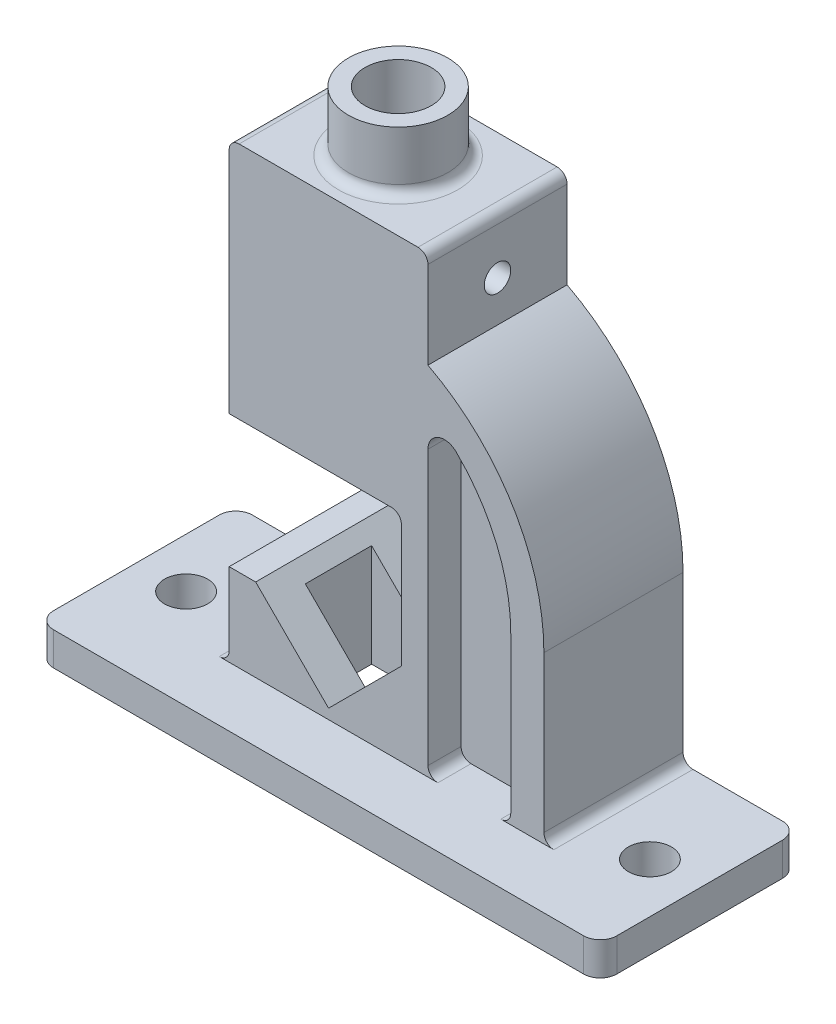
ISO-10303-21;
HEADER;
FILE_DESCRIPTION(('STEP AP214'),'2;1');
FILE_NAME('part.step','',(''),(''),'','','');
FILE_SCHEMA(('AUTOMOTIVE_DESIGN { 1 0 10303 214 1 1 1 1 }'));
ENDSEC;
DATA;
#1=APPLICATION_CONTEXT('core data for automotive mechanical design processes');
#2=APPLICATION_PROTOCOL_DEFINITION('international standard','automotive_design',2000,#1);
#3=PRODUCT_CONTEXT('',#1,'mechanical');
#4=PRODUCT('Part','Part','',(#3));
#5=PRODUCT_RELATED_PRODUCT_CATEGORY('part','',(#4));
#6=PRODUCT_DEFINITION_FORMATION('','',#4);
#7=PRODUCT_DEFINITION_CONTEXT('part definition',#1,'design');
#8=PRODUCT_DEFINITION('design','',#6,#7);
#9=PRODUCT_DEFINITION_SHAPE('','',#8);
#10=(LENGTH_UNIT() NAMED_UNIT(*) SI_UNIT(.MILLI.,.METRE.));
#11=(NAMED_UNIT(*) PLANE_ANGLE_UNIT() SI_UNIT($,.RADIAN.));
#12=(NAMED_UNIT(*) SI_UNIT($,.STERADIAN.) SOLID_ANGLE_UNIT());
#13=UNCERTAINTY_MEASURE_WITH_UNIT(LENGTH_MEASURE(1.E-05),#10,'distance_accuracy_value','');
#14=(GEOMETRIC_REPRESENTATION_CONTEXT(3) GLOBAL_UNCERTAINTY_ASSIGNED_CONTEXT((#13)) GLOBAL_UNIT_ASSIGNED_CONTEXT((#10,
#11,#12)) REPRESENTATION_CONTEXT('',''));
#15=CARTESIAN_POINT('',(0.,0.,0.));
#16=DIRECTION('',(0.,0.,1.));
#17=DIRECTION('',(1.,0.,0.));
#18=AXIS2_PLACEMENT_3D('',#15,#16,#17);
#19=CARTESIAN_POINT('',(85.,10.,-30.));
#20=DIRECTION('',(0.,-1.,0.));
#21=DIRECTION('',(0.,0.,-1.));
#22=AXIS2_PLACEMENT_3D('',#19,#20,#21);
#23=PLANE('',#22);
#24=DIRECTION('',(-1.,0.,0.));
#25=VECTOR('',#24,1.);
#26=CARTESIAN_POINT('',(-85.,10.,-30.));
#27=LINE('',#26,#25);
#28=CARTESIAN_POINT('',(80.,10.,-30.));
#29=VERTEX_POINT('',#28);
#30=CARTESIAN_POINT('',(53.,10.,-30.));
#31=VERTEX_POINT('',#30);
#32=EDGE_CURVE('E502',#29,#31,#27,.T.);
#33=ORIENTED_EDGE('',*,*,#32,.T.);
#34=DIRECTION('',(0.,0.,-1.));
#35=VECTOR('',#34,1.);
#36=CARTESIAN_POINT('',(53.,10.,-30.));
#37=LINE('',#36,#35);
#38=CARTESIAN_POINT('',(53.,10.,12.));
#39=VERTEX_POINT('',#38);
#40=EDGE_CURVE('E610',#31,#39,#37,.F.);
#41=ORIENTED_EDGE('',*,*,#40,.T.);
#42=DIRECTION('',(-1.,0.,0.));
#43=VECTOR('',#42,1.);
#44=CARTESIAN_POINT('',(50.,10.,12.));
#45=LINE('',#44,#43);
#46=CARTESIAN_POINT('',(37.,10.,12.));
#47=VERTEX_POINT('',#46);
#48=EDGE_CURVE('E407',#39,#47,#45,.T.);
#49=ORIENTED_EDGE('',*,*,#48,.T.);
#50=DIRECTION('',(0.,0.,1.));
#51=VECTOR('',#50,1.);
#52=CARTESIAN_POINT('',(37.,10.,2.));
#53=LINE('',#52,#51);
#54=CARTESIAN_POINT('',(37.,10.,2.));
#55=VERTEX_POINT('',#54);
#56=EDGE_CURVE('E608',#47,#55,#53,.F.);
#57=ORIENTED_EDGE('',*,*,#56,.T.);
#58=DIRECTION('',(1.,0.,0.));
#59=VECTOR('',#58,1.);
#60=CARTESIAN_POINT('',(15.,10.,2.));
#61=LINE('',#60,#59);
#62=CARTESIAN_POINT('',(18.,10.,2.));
#63=VERTEX_POINT('',#62);
#64=EDGE_CURVE('E764',#63,#55,#61,.T.);
#65=ORIENTED_EDGE('',*,*,#64,.F.);
#66=DIRECTION('',(0.,0.,1.));
#67=VECTOR('',#66,1.);
#68=CARTESIAN_POINT('',(18.,10.,12.));
#69=LINE('',#68,#67);
#70=CARTESIAN_POINT('',(18.,10.,12.));
#71=VERTEX_POINT('',#70);
#72=EDGE_CURVE('E605',#63,#71,#69,.T.);
#73=ORIENTED_EDGE('',*,*,#72,.T.);
#74=CARTESIAN_POINT('',(-48.,10.,12.));
#75=VERTEX_POINT('',#74);
#76=EDGE_CURVE('E410',#71,#75,#45,.T.);
#77=ORIENTED_EDGE('',*,*,#76,.T.);
#78=DIRECTION('',(0.,0.,-1.));
#79=VECTOR('',#78,1.);
#80=CARTESIAN_POINT('',(-48.,10.,-30.));
#81=LINE('',#80,#79);
#82=CARTESIAN_POINT('',(-48.,10.,-30.));
#83=VERTEX_POINT('',#82);
#84=EDGE_CURVE('E602',#75,#83,#81,.T.);
#85=ORIENTED_EDGE('',*,*,#84,.T.);
#86=CARTESIAN_POINT('',(-80.,10.,-30.));
#87=VERTEX_POINT('',#86);
#88=EDGE_CURVE('E491',#83,#87,#27,.T.);
#89=ORIENTED_EDGE('',*,*,#88,.T.);
#90=CARTESIAN_POINT('',(-80.,10.,-25.));
#91=DIRECTION('',(0.,-1.,0.));
#92=DIRECTION('',(0.,0.,-1.));
#93=AXIS2_PLACEMENT_3D('',#90,#91,#92);
#94=CIRCLE('',#93,5.);
#95=CARTESIAN_POINT('',(-85.,10.,-25.));
#96=VERTEX_POINT('',#95);
#97=EDGE_CURVE('E528',#87,#96,#94,.F.);
#98=ORIENTED_EDGE('',*,*,#97,.T.);
#99=DIRECTION('',(0.,0.,1.));
#100=VECTOR('',#99,1.);
#101=CARTESIAN_POINT('',(-85.,10.,30.));
#102=LINE('',#101,#100);
#103=CARTESIAN_POINT('',(-85.,10.,25.));
#104=VERTEX_POINT('',#103);
#105=EDGE_CURVE('E495',#96,#104,#102,.T.);
#106=ORIENTED_EDGE('',*,*,#105,.T.);
#107=CARTESIAN_POINT('',(-80.,10.,25.));
#108=DIRECTION('',(0.,-1.,0.));
#109=DIRECTION('',(0.,0.,-1.));
#110=AXIS2_PLACEMENT_3D('',#107,#108,#109);
#111=CIRCLE('',#110,5.);
#112=CARTESIAN_POINT('',(-80.,10.,30.));
#113=VERTEX_POINT('',#112);
#114=EDGE_CURVE('E532',#104,#113,#111,.F.);
#115=ORIENTED_EDGE('',*,*,#114,.T.);
#116=DIRECTION('',(1.,0.,0.));
#117=VECTOR('',#116,1.);
#118=CARTESIAN_POINT('',(-85.,10.,30.));
#119=LINE('',#118,#117);
#120=CARTESIAN_POINT('',(80.,10.,30.));
#121=VERTEX_POINT('',#120);
#122=EDGE_CURVE('E699',#113,#121,#119,.T.);
#123=ORIENTED_EDGE('',*,*,#122,.T.);
#124=CARTESIAN_POINT('',(80.,10.,25.));
#125=DIRECTION('',(0.,-1.,0.));
#126=DIRECTION('',(0.,0.,-1.));
#127=AXIS2_PLACEMENT_3D('',#124,#125,#126);
#128=CIRCLE('',#127,5.);
#129=CARTESIAN_POINT('',(85.,10.,25.));
#130=VERTEX_POINT('',#129);
#131=EDGE_CURVE('E530',#121,#130,#128,.F.);
#132=ORIENTED_EDGE('',*,*,#131,.T.);
#133=DIRECTION('',(0.,0.,-1.));
#134=VECTOR('',#133,1.);
#135=CARTESIAN_POINT('',(85.,10.,30.));
#136=LINE('',#135,#134);
#137=CARTESIAN_POINT('',(85.,10.,-25.));
#138=VERTEX_POINT('',#137);
#139=EDGE_CURVE('E488',#130,#138,#136,.T.);
#140=ORIENTED_EDGE('',*,*,#139,.T.);
#141=CARTESIAN_POINT('',(80.,10.,-25.));
#142=DIRECTION('',(0.,-1.,0.));
#143=DIRECTION('',(0.,0.,-1.));
#144=AXIS2_PLACEMENT_3D('',#141,#142,#143);
#145=CIRCLE('',#144,5.);
#146=EDGE_CURVE('E534',#138,#29,#145,.F.);
#147=ORIENTED_EDGE('',*,*,#146,.T.);
#148=EDGE_LOOP('',(#33,#41,#49,#57,#65,#73,#77,#85,#89,#98,#106,#115,#123,#132,#140,#147));
#149=FACE_BOUND('',#148,.T.);
#150=CARTESIAN_POINT('',(70.,10.,0.));
#151=DIRECTION('',(0.,1.,0.));
#152=DIRECTION('',(0.,0.,1.));
#153=AXIS2_PLACEMENT_3D('',#150,#151,#152);
#154=CIRCLE('',#153,6.5);
#155=CARTESIAN_POINT('',(70.,10.,6.5));
#156=VERTEX_POINT('',#155);
#157=EDGE_CURVE('E708',#156,#156,#154,.T.);
#158=ORIENTED_EDGE('',*,*,#157,.F.);
#159=EDGE_LOOP('',(#158));
#160=FACE_BOUND('',#159,.T.);
#161=CARTESIAN_POINT('',(-70.,10.,0.));
#162=DIRECTION('',(0.,-1.,0.));
#163=DIRECTION('',(0.,0.,1.));
#164=AXIS2_PLACEMENT_3D('',#161,#162,#163);
#165=CIRCLE('',#164,6.5);
#166=CARTESIAN_POINT('',(-70.,10.,6.5));
#167=VERTEX_POINT('',#166);
#168=EDGE_CURVE('E711',#167,#167,#165,.T.);
#169=ORIENTED_EDGE('',*,*,#168,.T.);
#170=EDGE_LOOP('',(#169));
#171=FACE_BOUND('',#170,.T.);
#172=ADVANCED_FACE('F34',(#149,#160,#171),#23,.F.);
#173=CARTESIAN_POINT('',(85.,0.,-30.));
#174=DIRECTION('',(0.,-1.,0.));
#175=DIRECTION('',(0.,0.,-1.));
#176=AXIS2_PLACEMENT_3D('',#173,#174,#175);
#177=PLANE('',#176);
#178=DIRECTION('',(-1.,0.,0.));
#179=VECTOR('',#178,1.);
#180=CARTESIAN_POINT('',(-85.,0.,-30.));
#181=LINE('',#180,#179);
#182=CARTESIAN_POINT('',(80.,0.,-30.));
#183=VERTEX_POINT('',#182);
#184=CARTESIAN_POINT('',(-80.,0.,-30.));
#185=VERTEX_POINT('',#184);
#186=EDGE_CURVE('E1437',#183,#185,#181,.T.);
#187=ORIENTED_EDGE('',*,*,#186,.F.);
#188=CARTESIAN_POINT('',(80.,0.,-25.));
#189=DIRECTION('',(0.,-1.,0.));
#190=DIRECTION('',(0.,0.,-1.));
#191=AXIS2_PLACEMENT_3D('',#188,#189,#190);
#192=CIRCLE('',#191,5.);
#193=CARTESIAN_POINT('',(85.,0.,-25.));
#194=VERTEX_POINT('',#193);
#195=EDGE_CURVE('E521',#183,#194,#192,.T.);
#196=ORIENTED_EDGE('',*,*,#195,.T.);
#197=DIRECTION('',(0.,0.,-1.));
#198=VECTOR('',#197,1.);
#199=CARTESIAN_POINT('',(85.,0.,30.));
#200=LINE('',#199,#198);
#201=CARTESIAN_POINT('',(85.,0.,25.));
#202=VERTEX_POINT('',#201);
#203=EDGE_CURVE('E469',#202,#194,#200,.T.);
#204=ORIENTED_EDGE('',*,*,#203,.F.);
#205=CARTESIAN_POINT('',(80.,0.,25.));
#206=DIRECTION('',(0.,-1.,0.));
#207=DIRECTION('',(0.,0.,-1.));
#208=AXIS2_PLACEMENT_3D('',#205,#206,#207);
#209=CIRCLE('',#208,5.);
#210=CARTESIAN_POINT('',(80.,0.,30.));
#211=VERTEX_POINT('',#210);
#212=EDGE_CURVE('E517',#202,#211,#209,.T.);
#213=ORIENTED_EDGE('',*,*,#212,.T.);
#214=DIRECTION('',(1.,0.,0.));
#215=VECTOR('',#214,1.);
#216=CARTESIAN_POINT('',(-85.,0.,30.));
#217=LINE('',#216,#215);
#218=CARTESIAN_POINT('',(-80.,0.,30.));
#219=VERTEX_POINT('',#218);
#220=EDGE_CURVE('E492',#219,#211,#217,.T.);
#221=ORIENTED_EDGE('',*,*,#220,.F.);
#222=CARTESIAN_POINT('',(-80.,0.,25.));
#223=DIRECTION('',(0.,-1.,0.));
#224=DIRECTION('',(0.,0.,-1.));
#225=AXIS2_PLACEMENT_3D('',#222,#223,#224);
#226=CIRCLE('',#225,5.);
#227=CARTESIAN_POINT('',(-85.,0.,25.));
#228=VERTEX_POINT('',#227);
#229=EDGE_CURVE('E519',#219,#228,#226,.T.);
#230=ORIENTED_EDGE('',*,*,#229,.T.);
#231=DIRECTION('',(0.,0.,1.));
#232=VECTOR('',#231,1.);
#233=CARTESIAN_POINT('',(-85.,0.,30.));
#234=LINE('',#233,#232);
#235=CARTESIAN_POINT('',(-85.,0.,-25.));
#236=VERTEX_POINT('',#235);
#237=EDGE_CURVE('E1434',#236,#228,#234,.T.);
#238=ORIENTED_EDGE('',*,*,#237,.F.);
#239=CARTESIAN_POINT('',(-80.,0.,-25.));
#240=DIRECTION('',(0.,-1.,0.));
#241=DIRECTION('',(0.,0.,-1.));
#242=AXIS2_PLACEMENT_3D('',#239,#240,#241);
#243=CIRCLE('',#242,5.);
#244=EDGE_CURVE('E515',#236,#185,#243,.T.);
#245=ORIENTED_EDGE('',*,*,#244,.T.);
#246=EDGE_LOOP('',(#187,#196,#204,#213,#221,#230,#238,#245));
#247=FACE_BOUND('',#246,.T.);
#248=DIRECTION('',(0.,0.,1.));
#249=VECTOR('',#248,1.);
#250=CARTESIAN_POINT('',(-33.,0.,-19.));
#251=LINE('',#250,#249);
#252=CARTESIAN_POINT('',(-33.,0.,-19.));
#253=VERTEX_POINT('',#252);
#254=CARTESIAN_POINT('',(-33.,0.,1.));
#255=VERTEX_POINT('',#254);
#256=EDGE_CURVE('E788',#253,#255,#251,.T.);
#257=ORIENTED_EDGE('',*,*,#256,.T.);
#258=DIRECTION('',(1.,0.,0.));
#259=VECTOR('',#258,1.);
#260=CARTESIAN_POINT('',(-33.,0.,1.));
#261=LINE('',#260,#259);
#262=CARTESIAN_POINT('',(7.00000000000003,0.,1.));
#263=VERTEX_POINT('',#262);
#264=EDGE_CURVE('E793',#255,#263,#261,.T.);
#265=ORIENTED_EDGE('',*,*,#264,.T.);
#266=DIRECTION('',(0.,0.,-1.));
#267=VECTOR('',#266,1.);
#268=CARTESIAN_POINT('',(7.00000000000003,0.,-19.));
#269=LINE('',#268,#267);
#270=CARTESIAN_POINT('',(7.00000000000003,0.,-19.));
#271=VERTEX_POINT('',#270);
#272=EDGE_CURVE('E807',#263,#271,#269,.T.);
#273=ORIENTED_EDGE('',*,*,#272,.T.);
#274=DIRECTION('',(-1.,0.,0.));
#275=VECTOR('',#274,1.);
#276=CARTESIAN_POINT('',(-33.,0.,-19.));
#277=LINE('',#276,#275);
#278=EDGE_CURVE('E810',#271,#253,#277,.T.);
#279=ORIENTED_EDGE('',*,*,#278,.T.);
#280=EDGE_LOOP('',(#257,#265,#273,#279));
#281=FACE_BOUND('',#280,.T.);
#282=CARTESIAN_POINT('',(70.,0.,0.));
#283=DIRECTION('',(0.,-1.,0.));
#284=DIRECTION('',(0.,0.,-1.));
#285=AXIS2_PLACEMENT_3D('',#282,#283,#284);
#286=CIRCLE('',#285,6.5);
#287=CARTESIAN_POINT('',(70.,0.,-6.5));
#288=VERTEX_POINT('',#287);
#289=EDGE_CURVE('E706',#288,#288,#286,.T.);
#290=ORIENTED_EDGE('',*,*,#289,.F.);
#291=EDGE_LOOP('',(#290));
#292=FACE_BOUND('',#291,.T.);
#293=CARTESIAN_POINT('',(-70.,0.,0.));
#294=DIRECTION('',(0.,-1.,0.));
#295=DIRECTION('',(0.,0.,-1.));
#296=AXIS2_PLACEMENT_3D('',#293,#294,#295);
#297=CIRCLE('',#296,6.5);
#298=CARTESIAN_POINT('',(-70.,0.,-6.5));
#299=VERTEX_POINT('',#298);
#300=EDGE_CURVE('E709',#299,#299,#297,.F.);
#301=ORIENTED_EDGE('',*,*,#300,.T.);
#302=EDGE_LOOP('',(#301));
#303=FACE_BOUND('',#302,.T.);
#304=ADVANCED_FACE('F845',(#247,#281,#292,#303),#177,.T.);
#305=CARTESIAN_POINT('',(-45.,137.,12.));
#306=DIRECTION('',(0.,1.,0.));
#307=DIRECTION('',(0.,0.,1.));
#308=AXIS2_PLACEMENT_3D('',#305,#306,#307);
#309=PLANE('',#308);
#310=CARTESIAN_POINT('',(-15.,137.,-9.));
#311=DIRECTION('',(0.,1.,0.));
#312=DIRECTION('',(0.,0.,1.));
#313=AXIS2_PLACEMENT_3D('',#310,#311,#312);
#314=CIRCLE('',#313,10.);
#315=CARTESIAN_POINT('',(-15.,137.,1.));
#316=VERTEX_POINT('',#315);
#317=CARTESIAN_POINT('',(-15.,137.,-19.));
#318=VERTEX_POINT('',#317);
#319=EDGE_CURVE('E357',#316,#318,#314,.F.);
#320=ORIENTED_EDGE('',*,*,#319,.F.);
#321=DIRECTION('',(1.,0.,0.));
#322=VECTOR('',#321,1.);
#323=CARTESIAN_POINT('',(-33.0000000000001,137.,1.));
#324=LINE('',#323,#322);
#325=CARTESIAN_POINT('',(-33.0000000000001,137.,1.));
#326=VERTEX_POINT('',#325);
#327=EDGE_CURVE('E368',#326,#316,#324,.T.);
#328=ORIENTED_EDGE('',*,*,#327,.F.);
#329=DIRECTION('',(0.,0.,1.));
#330=VECTOR('',#329,1.);
#331=CARTESIAN_POINT('',(-33.0000000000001,137.,-19.));
#332=LINE('',#331,#330);
#333=CARTESIAN_POINT('',(-33.0000000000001,137.,-19.));
#334=VERTEX_POINT('',#333);
#335=EDGE_CURVE('E380',#334,#326,#332,.T.);
#336=ORIENTED_EDGE('',*,*,#335,.F.);
#337=DIRECTION('',(-1.,0.,0.));
#338=VECTOR('',#337,1.);
#339=CARTESIAN_POINT('',(-33.0000000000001,137.,-19.));
#340=LINE('',#339,#338);
#341=EDGE_CURVE('E370',#318,#334,#340,.T.);
#342=ORIENTED_EDGE('',*,*,#341,.F.);
#343=EDGE_LOOP('',(#320,#328,#336,#342));
#344=FACE_BOUND('',#343,.T.);
#345=ADVANCED_FACE('F365',(#344),#309,.F.);
#346=EDGE_CURVE('E353',#318,#316,#314,.F.);
#347=ORIENTED_EDGE('',*,*,#346,.F.);
#348=CARTESIAN_POINT('',(6.99999999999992,137.,-19.));
#349=VERTEX_POINT('',#348);
#350=EDGE_CURVE('E391',#349,#318,#340,.T.);
#351=ORIENTED_EDGE('',*,*,#350,.F.);
#352=DIRECTION('',(0.,0.,-1.));
#353=VECTOR('',#352,1.);
#354=CARTESIAN_POINT('',(6.99999999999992,137.,-19.));
#355=LINE('',#354,#353);
#356=CARTESIAN_POINT('',(6.99999999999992,137.,1.));
#357=VERTEX_POINT('',#356);
#358=EDGE_CURVE('E377',#357,#349,#355,.T.);
#359=ORIENTED_EDGE('',*,*,#358,.F.);
#360=EDGE_CURVE('E374',#316,#357,#324,.T.);
#361=ORIENTED_EDGE('',*,*,#360,.F.);
#362=EDGE_LOOP('',(#347,#351,#359,#361));
#363=FACE_BOUND('',#362,.T.);
#364=ADVANCED_FACE('F375',(#363),#309,.F.);
#365=CARTESIAN_POINT('',(-45.,147.,12.));
#366=DIRECTION('',(0.,1.,0.));
#367=DIRECTION('',(0.,0.,1.));
#368=AXIS2_PLACEMENT_3D('',#365,#366,#367);
#369=PLANE('',#368);
#370=CARTESIAN_POINT('',(-15.,147.,-9.));
#371=DIRECTION('',(0.,1.,0.));
#372=DIRECTION('',(0.,0.,1.));
#373=AXIS2_PLACEMENT_3D('',#370,#371,#372);
#374=CIRCLE('',#373,18.);
#375=CARTESIAN_POINT('',(-15.,147.,9.));
#376=VERTEX_POINT('',#375);
#377=EDGE_CURVE('E554',#376,#376,#374,.F.);
#378=ORIENTED_EDGE('',*,*,#377,.T.);
#379=EDGE_LOOP('',(#378));
#380=FACE_BOUND('',#379,.T.);
#381=DIRECTION('',(1.,0.,0.));
#382=VECTOR('',#381,1.);
#383=CARTESIAN_POINT('',(-45.,147.,-30.));
#384=LINE('',#383,#382);
#385=CARTESIAN_POINT('',(-42.,147.,-30.));
#386=VERTEX_POINT('',#385);
#387=CARTESIAN_POINT('',(12.,147.,-30.));
#388=VERTEX_POINT('',#387);
#389=EDGE_CURVE('E458',#386,#388,#384,.T.);
#390=ORIENTED_EDGE('',*,*,#389,.F.);
#391=DIRECTION('',(0.,0.,-1.));
#392=VECTOR('',#391,1.);
#393=CARTESIAN_POINT('',(-42.,147.,12.));
#394=LINE('',#393,#392);
#395=CARTESIAN_POINT('',(-42.,147.,12.));
#396=VERTEX_POINT('',#395);
#397=EDGE_CURVE('E552',#386,#396,#394,.F.);
#398=ORIENTED_EDGE('',*,*,#397,.T.);
#399=DIRECTION('',(1.,0.,0.));
#400=VECTOR('',#399,1.);
#401=CARTESIAN_POINT('',(-45.,147.,12.));
#402=LINE('',#401,#400);
#403=CARTESIAN_POINT('',(12.,147.,12.));
#404=VERTEX_POINT('',#403);
#405=EDGE_CURVE('E429',#396,#404,#402,.T.);
#406=ORIENTED_EDGE('',*,*,#405,.T.);
#407=DIRECTION('',(0.,0.,-1.));
#408=VECTOR('',#407,1.);
#409=CARTESIAN_POINT('',(12.,147.,12.));
#410=LINE('',#409,#408);
#411=EDGE_CURVE('E549',#404,#388,#410,.T.);
#412=ORIENTED_EDGE('',*,*,#411,.T.);
#413=EDGE_LOOP('',(#390,#398,#406,#412));
#414=FACE_BOUND('',#413,.T.);
#415=ADVANCED_FACE('F869',(#380,#414),#369,.T.);
#416=CARTESIAN_POINT('',(-85.,10.,-30.));
#417=DIRECTION('',(0.,0.,1.));
#418=DIRECTION('',(1.,0.,0.));
#419=AXIS2_PLACEMENT_3D('',#416,#417,#418);
#420=PLANE('',#419);
#421=DIRECTION('',(0.,1.,0.));
#422=VECTOR('',#421,1.);
#423=CARTESIAN_POINT('',(-45.,75.,-30.));
#424=LINE('',#423,#422);
#425=CARTESIAN_POINT('',(-45.,75.,-30.));
#426=VERTEX_POINT('',#425);
#427=CARTESIAN_POINT('',(-45.,144.,-30.));
#428=VERTEX_POINT('',#427);
#429=EDGE_CURVE('E455',#426,#428,#424,.T.);
#430=ORIENTED_EDGE('',*,*,#429,.T.);
#431=CARTESIAN_POINT('',(-42.,144.,-30.));
#432=DIRECTION('',(0.,0.,1.));
#433=DIRECTION('',(1.,0.,0.));
#434=AXIS2_PLACEMENT_3D('',#431,#432,#433);
#435=CIRCLE('',#434,3.);
#436=EDGE_CURVE('E586',#428,#386,#435,.F.);
#437=ORIENTED_EDGE('',*,*,#436,.T.);
#438=ORIENTED_EDGE('',*,*,#389,.T.);
#439=CARTESIAN_POINT('',(12.,144.,-30.));
#440=DIRECTION('',(0.,0.,1.));
#441=DIRECTION('',(1.,0.,0.));
#442=AXIS2_PLACEMENT_3D('',#439,#440,#441);
#443=CIRCLE('',#442,3.);
#444=CARTESIAN_POINT('',(15.,144.,-30.));
#445=VERTEX_POINT('',#444);
#446=EDGE_CURVE('E582',#388,#445,#443,.F.);
#447=ORIENTED_EDGE('',*,*,#446,.T.);
#448=DIRECTION('',(0.,-1.,0.));
#449=VECTOR('',#448,1.);
#450=CARTESIAN_POINT('',(15.,147.,-30.));
#451=LINE('',#450,#449);
#452=CARTESIAN_POINT('',(15.,117.662812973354,-30.));
#453=VERTEX_POINT('',#452);
#454=EDGE_CURVE('E461',#445,#453,#451,.T.);
#455=ORIENTED_EDGE('',*,*,#454,.T.);
#456=CARTESIAN_POINT('',(-15.,60.,-30.));
#457=DIRECTION('',(0.,0.,-1.));
#458=DIRECTION('',(-1.,0.,0.));
#459=AXIS2_PLACEMENT_3D('',#456,#457,#458);
#460=CIRCLE('',#459,65.);
#461=CARTESIAN_POINT('',(50.,60.,-30.));
#462=VERTEX_POINT('',#461);
#463=EDGE_CURVE('E463',#453,#462,#460,.T.);
#464=ORIENTED_EDGE('',*,*,#463,.T.);
#465=DIRECTION('',(0.,-1.,0.));
#466=VECTOR('',#465,1.);
#467=CARTESIAN_POINT('',(50.,60.,-30.));
#468=LINE('',#467,#466);
#469=CARTESIAN_POINT('',(50.,13.,-30.));
#470=VERTEX_POINT('',#469);
#471=EDGE_CURVE('E466',#462,#470,#468,.T.);
#472=ORIENTED_EDGE('',*,*,#471,.T.);
#473=CARTESIAN_POINT('',(53.,13.,-30.));
#474=DIRECTION('',(0.,0.,1.));
#475=DIRECTION('',(1.,0.,0.));
#476=AXIS2_PLACEMENT_3D('',#473,#474,#475);
#477=CIRCLE('',#476,3.);
#478=EDGE_CURVE('E635',#470,#31,#477,.T.);
#479=ORIENTED_EDGE('',*,*,#478,.T.);
#480=ORIENTED_EDGE('',*,*,#32,.F.);
#481=DIRECTION('',(0.,-1.,0.));
#482=VECTOR('',#481,1.);
#483=CARTESIAN_POINT('',(80.,10.,-30.));
#484=LINE('',#483,#482);
#485=EDGE_CURVE('E511',#29,#183,#484,.T.);
#486=ORIENTED_EDGE('',*,*,#485,.T.);
#487=ORIENTED_EDGE('',*,*,#186,.T.);
#488=DIRECTION('',(0.,-1.,0.));
#489=VECTOR('',#488,1.);
#490=CARTESIAN_POINT('',(-80.,10.,-30.));
#491=LINE('',#490,#489);
#492=EDGE_CURVE('E508',#185,#87,#491,.F.);
#493=ORIENTED_EDGE('',*,*,#492,.T.);
#494=ORIENTED_EDGE('',*,*,#88,.F.);
#495=CARTESIAN_POINT('',(-48.,13.,-30.));
#496=DIRECTION('',(0.,0.,1.));
#497=DIRECTION('',(1.,0.,0.));
#498=AXIS2_PLACEMENT_3D('',#495,#496,#497);
#499=CIRCLE('',#498,3.);
#500=CARTESIAN_POINT('',(-45.,13.,-30.));
#501=VERTEX_POINT('',#500);
#502=EDGE_CURVE('E42',#83,#501,#499,.T.);
#503=ORIENTED_EDGE('',*,*,#502,.T.);
#504=DIRECTION('',(0.,1.,0.));
#505=VECTOR('',#504,1.);
#506=CARTESIAN_POINT('',(-45.,10.,-30.));
#507=LINE('',#506,#505);
#508=CARTESIAN_POINT('',(-45.,35.,-30.));
#509=VERTEX_POINT('',#508);
#510=EDGE_CURVE('E406',#501,#509,#507,.T.);
#511=ORIENTED_EDGE('',*,*,#510,.T.);
#512=DIRECTION('',(1.,0.,0.));
#513=VECTOR('',#512,1.);
#514=CARTESIAN_POINT('',(-37.,35.,-30.));
#515=LINE('',#514,#513);
#516=CARTESIAN_POINT('',(-37.,35.,-30.));
#517=VERTEX_POINT('',#516);
#518=EDGE_CURVE('E441',#509,#517,#515,.T.);
#519=ORIENTED_EDGE('',*,*,#518,.T.);
#520=DIRECTION('',(0.707106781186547,-0.707106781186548,0.));
#521=VECTOR('',#520,1.);
#522=CARTESIAN_POINT('',(-15.,12.9999999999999,-30.));
#523=LINE('',#522,#521);
#524=CARTESIAN_POINT('',(-15.,12.9999999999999,-30.));
#525=VERTEX_POINT('',#524);
#526=EDGE_CURVE('E444',#517,#525,#523,.T.);
#527=ORIENTED_EDGE('',*,*,#526,.T.);
#528=DIRECTION('',(0.707106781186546,0.707106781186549,0.));
#529=VECTOR('',#528,1.);
#530=CARTESIAN_POINT('',(7.,35.,-30.));
#531=LINE('',#530,#529);
#532=CARTESIAN_POINT('',(7.,35.,-30.));
#533=VERTEX_POINT('',#532);
#534=EDGE_CURVE('E447',#525,#533,#531,.T.);
#535=ORIENTED_EDGE('',*,*,#534,.T.);
#536=DIRECTION('',(0.,1.,0.));
#537=VECTOR('',#536,1.);
#538=CARTESIAN_POINT('',(7.,35.,-30.));
#539=LINE('',#538,#537);
#540=CARTESIAN_POINT('',(7.00000000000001,72.,-30.));
#541=VERTEX_POINT('',#540);
#542=EDGE_CURVE('E450',#533,#541,#539,.T.);
#543=ORIENTED_EDGE('',*,*,#542,.T.);
#544=CARTESIAN_POINT('',(4.00000000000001,72.,-30.));
#545=DIRECTION('',(0.,0.,1.));
#546=DIRECTION('',(1.,0.,0.));
#547=AXIS2_PLACEMENT_3D('',#544,#545,#546);
#548=CIRCLE('',#547,3.);
#549=CARTESIAN_POINT('',(4.00000000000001,75.,-30.));
#550=VERTEX_POINT('',#549);
#551=EDGE_CURVE('E626',#541,#550,#548,.T.);
#552=ORIENTED_EDGE('',*,*,#551,.T.);
#553=DIRECTION('',(-1.,0.,0.));
#554=VECTOR('',#553,1.);
#555=CARTESIAN_POINT('',(7.00000000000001,75.,-30.));
#556=LINE('',#555,#554);
#557=EDGE_CURVE('E453',#550,#426,#556,.T.);
#558=ORIENTED_EDGE('',*,*,#557,.T.);
#559=EDGE_LOOP('',(#430,#437,#438,#447,#455,#464,#472,#479,#480,#486,#487,#493,#494,#503,#511,
#519,#527,#535,#543,#552,#558));
#560=FACE_BOUND('',#559,.T.);
#561=DIRECTION('',(0.,-1.,0.));
#562=VECTOR('',#561,1.);
#563=CARTESIAN_POINT('',(15.,95.7071421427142,-30.));
#564=LINE('',#563,#562);
#565=CARTESIAN_POINT('',(15.,95.7071421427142,-30.));
#566=VERTEX_POINT('',#565);
#567=CARTESIAN_POINT('',(15.,13.,-30.));
#568=VERTEX_POINT('',#567);
#569=EDGE_CURVE('E747',#566,#568,#564,.T.);
#570=ORIENTED_EDGE('',*,*,#569,.T.);
#571=CARTESIAN_POINT('',(18.,13.,-30.));
#572=DIRECTION('',(0.,0.,1.));
#573=DIRECTION('',(1.,0.,0.));
#574=AXIS2_PLACEMENT_3D('',#571,#572,#573);
#575=CIRCLE('',#574,3.);
#576=CARTESIAN_POINT('',(18.,10.,-30.));
#577=VERTEX_POINT('',#576);
#578=EDGE_CURVE('E633',#568,#577,#575,.T.);
#579=ORIENTED_EDGE('',*,*,#578,.T.);
#580=DIRECTION('',(1.,0.,0.));
#581=VECTOR('',#580,1.);
#582=CARTESIAN_POINT('',(15.,10.,-30.));
#583=LINE('',#582,#581);
#584=CARTESIAN_POINT('',(37.,10.,-30.));
#585=VERTEX_POINT('',#584);
#586=EDGE_CURVE('E730',#577,#585,#583,.T.);
#587=ORIENTED_EDGE('',*,*,#586,.T.);
#588=CARTESIAN_POINT('',(37.,13.,-30.));
#589=DIRECTION('',(0.,0.,1.));
#590=DIRECTION('',(1.,0.,0.));
#591=AXIS2_PLACEMENT_3D('',#588,#589,#590);
#592=CIRCLE('',#591,3.);
#593=CARTESIAN_POINT('',(40.,13.,-30.));
#594=VERTEX_POINT('',#593);
#595=EDGE_CURVE('E631',#585,#594,#592,.T.);
#596=ORIENTED_EDGE('',*,*,#595,.T.);
#597=DIRECTION('',(0.,1.,0.));
#598=VECTOR('',#597,1.);
#599=CARTESIAN_POINT('',(40.,10.,-30.));
#600=LINE('',#599,#598);
#601=CARTESIAN_POINT('',(40.,60.,-30.));
#602=VERTEX_POINT('',#601);
#603=EDGE_CURVE('E735',#594,#602,#600,.T.);
#604=ORIENTED_EDGE('',*,*,#603,.T.);
#605=CARTESIAN_POINT('',(-15.,60.,-30.));
#606=DIRECTION('',(0.,0.,1.));
#607=DIRECTION('',(1.,0.,0.));
#608=AXIS2_PLACEMENT_3D('',#605,#606,#607);
#609=CIRCLE('',#608,55.);
#610=CARTESIAN_POINT('',(23.5,99.2778563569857,-30.));
#611=VERTEX_POINT('',#610);
#612=EDGE_CURVE('E753',#602,#611,#609,.T.);
#613=ORIENTED_EDGE('',*,*,#612,.T.);
#614=CARTESIAN_POINT('',(20.,95.7071421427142,-30.));
#615=DIRECTION('',(0.,0.,1.));
#616=DIRECTION('',(1.,0.,0.));
#617=AXIS2_PLACEMENT_3D('',#614,#615,#616);
#618=CIRCLE('',#617,5.);
#619=EDGE_CURVE('E750',#611,#566,#618,.T.);
#620=ORIENTED_EDGE('',*,*,#619,.T.);
#621=EDGE_LOOP('',(#570,#579,#587,#596,#604,#613,#620));
#622=FACE_BOUND('',#621,.T.);
#623=ADVANCED_FACE('F645',(#560,#622),#420,.F.);
#624=CARTESIAN_POINT('',(7.,35.,12.));
#625=DIRECTION('',(-0.707106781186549,0.707106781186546,0.));
#626=DIRECTION('',(-0.707106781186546,-0.707106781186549,0.));
#627=AXIS2_PLACEMENT_3D('',#624,#625,#626);
#628=PLANE('',#627);
#629=DIRECTION('',(0.707106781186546,0.707106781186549,0.));
#630=VECTOR('',#629,1.);
#631=CARTESIAN_POINT('',(-30.5005,-2.50050000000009,-19.));
#632=LINE('',#631,#630);
#633=CARTESIAN_POINT('',(-15.,12.9999999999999,-19.));
#634=VERTEX_POINT('',#633);
#635=CARTESIAN_POINT('',(7.,35.,-19.));
#636=VERTEX_POINT('',#635);
#637=EDGE_CURVE('E678',#634,#636,#632,.T.);
#638=ORIENTED_EDGE('',*,*,#637,.T.);
#639=DIRECTION('',(0.,0.,-1.));
#640=VECTOR('',#639,1.);
#641=CARTESIAN_POINT('',(7.,35.,12.));
#642=LINE('',#641,#640);
#643=EDGE_CURVE('E479',#636,#533,#642,.T.);
#644=ORIENTED_EDGE('',*,*,#643,.T.);
#645=ORIENTED_EDGE('',*,*,#534,.F.);
#646=DIRECTION('',(0.,0.,-1.));
#647=VECTOR('',#646,1.);
#648=CARTESIAN_POINT('',(-15.,12.9999999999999,12.));
#649=LINE('',#648,#647);
#650=EDGE_CURVE('E483',#634,#525,#649,.T.);
#651=ORIENTED_EDGE('',*,*,#650,.F.);
#652=EDGE_LOOP('',(#638,#644,#645,#651));
#653=FACE_BOUND('',#652,.T.);
#654=ADVANCED_FACE('F675',(#653),#628,.T.);
#655=CARTESIAN_POINT('',(7.00000000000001,75.,12.));
#656=DIRECTION('',(0.,-1.,0.));
#657=DIRECTION('',(0.,0.,-1.));
#658=AXIS2_PLACEMENT_3D('',#655,#656,#657);
#659=PLANE('',#658);
#660=DIRECTION('',(1.,0.,0.));
#661=VECTOR('',#660,1.);
#662=CARTESIAN_POINT('',(7.00000000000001,75.,1.));
#663=LINE('',#662,#661);
#664=CARTESIAN_POINT('',(-33.,75.,1.));
#665=VERTEX_POINT('',#664);
#666=CARTESIAN_POINT('',(4.00000000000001,75.,1.));
#667=VERTEX_POINT('',#666);
#668=EDGE_CURVE('E403',#665,#667,#663,.T.);
#669=ORIENTED_EDGE('',*,*,#668,.T.);
#670=DIRECTION('',(0.,0.,-1.));
#671=VECTOR('',#670,1.);
#672=CARTESIAN_POINT('',(4.00000000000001,75.,12.));
#673=LINE('',#672,#671);
#674=CARTESIAN_POINT('',(4.00000000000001,75.,12.));
#675=VERTEX_POINT('',#674);
#676=EDGE_CURVE('E565',#667,#675,#673,.F.);
#677=ORIENTED_EDGE('',*,*,#676,.T.);
#678=DIRECTION('',(-1.,0.,0.));
#679=VECTOR('',#678,1.);
#680=CARTESIAN_POINT('',(7.00000000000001,75.,12.));
#681=LINE('',#680,#679);
#682=CARTESIAN_POINT('',(-45.,75.,12.));
#683=VERTEX_POINT('',#682);
#684=EDGE_CURVE('E424',#675,#683,#681,.T.);
#685=ORIENTED_EDGE('',*,*,#684,.T.);
#686=DIRECTION('',(0.,0.,-1.));
#687=VECTOR('',#686,1.);
#688=CARTESIAN_POINT('',(-45.,75.,12.));
#689=LINE('',#688,#687);
#690=EDGE_CURVE('E473',#683,#426,#689,.T.);
#691=ORIENTED_EDGE('',*,*,#690,.T.);
#692=ORIENTED_EDGE('',*,*,#557,.F.);
#693=DIRECTION('',(0.,0.,-1.));
#694=VECTOR('',#693,1.);
#695=CARTESIAN_POINT('',(4.00000000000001,75.,-19.));
#696=LINE('',#695,#694);
#697=CARTESIAN_POINT('',(4.00000000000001,75.,-19.));
#698=VERTEX_POINT('',#697);
#699=EDGE_CURVE('E563',#550,#698,#696,.F.);
#700=ORIENTED_EDGE('',*,*,#699,.T.);
#701=DIRECTION('',(-1.,0.,0.));
#702=VECTOR('',#701,1.);
#703=CARTESIAN_POINT('',(7.00000000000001,75.,-19.));
#704=LINE('',#703,#702);
#705=CARTESIAN_POINT('',(-33.0000000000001,75.,-19.));
#706=VERTEX_POINT('',#705);
#707=EDGE_CURVE('E386',#698,#706,#704,.T.);
#708=ORIENTED_EDGE('',*,*,#707,.T.);
#709=DIRECTION('',(0.,0.,1.));
#710=VECTOR('',#709,1.);
#711=CARTESIAN_POINT('',(-33.,75.,12.));
#712=LINE('',#711,#710);
#713=EDGE_CURVE('E512',#706,#665,#712,.T.);
#714=ORIENTED_EDGE('',*,*,#713,.T.);
#715=EDGE_LOOP('',(#669,#677,#685,#691,#692,#700,#708,#714));
#716=FACE_BOUND('',#715,.T.);
#717=ADVANCED_FACE('F687',(#716),#659,.T.);
#718=CARTESIAN_POINT('',(85.,10.,30.));
#719=DIRECTION('',(-1.,0.,0.));
#720=DIRECTION('',(0.,0.,1.));
#721=AXIS2_PLACEMENT_3D('',#718,#719,#720);
#722=PLANE('',#721);
#723=ORIENTED_EDGE('',*,*,#203,.T.);
#724=DIRECTION('',(0.,-1.,0.));
#725=VECTOR('',#724,1.);
#726=CARTESIAN_POINT('',(85.,10.,-25.));
#727=LINE('',#726,#725);
#728=EDGE_CURVE('E526',#194,#138,#727,.F.);
#729=ORIENTED_EDGE('',*,*,#728,.T.);
#730=ORIENTED_EDGE('',*,*,#139,.F.);
#731=DIRECTION('',(0.,-1.,0.));
#732=VECTOR('',#731,1.);
#733=CARTESIAN_POINT('',(85.,10.,25.));
#734=LINE('',#733,#732);
#735=EDGE_CURVE('E523',#130,#202,#734,.T.);
#736=ORIENTED_EDGE('',*,*,#735,.T.);
#737=EDGE_LOOP('',(#723,#729,#730,#736));
#738=FACE_BOUND('',#737,.T.);
#739=ADVANCED_FACE('F865',(#738),#722,.F.);
#740=CARTESIAN_POINT('',(-85.,10.,30.));
#741=DIRECTION('',(1.,0.,0.));
#742=DIRECTION('',(0.,0.,-1.));
#743=AXIS2_PLACEMENT_3D('',#740,#741,#742);
#744=PLANE('',#743);
#745=ORIENTED_EDGE('',*,*,#237,.T.);
#746=DIRECTION('',(0.,-1.,0.));
#747=VECTOR('',#746,1.);
#748=CARTESIAN_POINT('',(-85.,10.,25.));
#749=LINE('',#748,#747);
#750=EDGE_CURVE('E544',#228,#104,#749,.F.);
#751=ORIENTED_EDGE('',*,*,#750,.T.);
#752=ORIENTED_EDGE('',*,*,#105,.F.);
#753=DIRECTION('',(0.,-1.,0.));
#754=VECTOR('',#753,1.);
#755=CARTESIAN_POINT('',(-85.,10.,-25.));
#756=LINE('',#755,#754);
#757=EDGE_CURVE('E541',#96,#236,#756,.T.);
#758=ORIENTED_EDGE('',*,*,#757,.T.);
#759=EDGE_LOOP('',(#745,#751,#752,#758));
#760=FACE_BOUND('',#759,.T.);
#761=ADVANCED_FACE('F861',(#760),#744,.F.);
#762=CARTESIAN_POINT('',(-85.,10.,30.));
#763=DIRECTION('',(0.,0.,-1.));
#764=DIRECTION('',(-1.,0.,0.));
#765=AXIS2_PLACEMENT_3D('',#762,#763,#764);
#766=PLANE('',#765);
#767=ORIENTED_EDGE('',*,*,#122,.F.);
#768=DIRECTION('',(0.,-1.,0.));
#769=VECTOR('',#768,1.);
#770=CARTESIAN_POINT('',(-80.,10.,30.));
#771=LINE('',#770,#769);
#772=EDGE_CURVE('E538',#113,#219,#771,.T.);
#773=ORIENTED_EDGE('',*,*,#772,.T.);
#774=ORIENTED_EDGE('',*,*,#220,.T.);
#775=DIRECTION('',(0.,-1.,0.));
#776=VECTOR('',#775,1.);
#777=CARTESIAN_POINT('',(80.,10.,30.));
#778=LINE('',#777,#776);
#779=EDGE_CURVE('E536',#211,#121,#778,.F.);
#780=ORIENTED_EDGE('',*,*,#779,.T.);
#781=EDGE_LOOP('',(#767,#773,#774,#780));
#782=FACE_BOUND('',#781,.T.);
#783=ADVANCED_FACE('F857',(#782),#766,.F.);
#784=CARTESIAN_POINT('',(50.,60.,12.));
#785=DIRECTION('',(1.,0.,0.));
#786=DIRECTION('',(0.,1.,0.));
#787=AXIS2_PLACEMENT_3D('',#784,#785,#786);
#788=PLANE('',#787);
#789=DIRECTION('',(0.,-1.,0.));
#790=VECTOR('',#789,1.);
#791=CARTESIAN_POINT('',(50.,60.,12.));
#792=LINE('',#791,#790);
#793=CARTESIAN_POINT('',(50.,60.,12.));
#794=VERTEX_POINT('',#793);
#795=CARTESIAN_POINT('',(50.,13.,12.));
#796=VERTEX_POINT('',#795);
#797=EDGE_CURVE('E437',#794,#796,#792,.T.);
#798=ORIENTED_EDGE('',*,*,#797,.T.);
#799=DIRECTION('',(0.,0.,-1.));
#800=VECTOR('',#799,1.);
#801=CARTESIAN_POINT('',(50.,13.,12.));
#802=LINE('',#801,#800);
#803=EDGE_CURVE('E599',#796,#470,#802,.T.);
#804=ORIENTED_EDGE('',*,*,#803,.T.);
#805=ORIENTED_EDGE('',*,*,#471,.F.);
#806=DIRECTION('',(0.,0.,-1.));
#807=VECTOR('',#806,1.);
#808=CARTESIAN_POINT('',(50.,60.,12.));
#809=LINE('',#808,#807);
#810=EDGE_CURVE('E467',#794,#462,#809,.T.);
#811=ORIENTED_EDGE('',*,*,#810,.F.);
#812=EDGE_LOOP('',(#798,#804,#805,#811));
#813=FACE_BOUND('',#812,.T.);
#814=ADVANCED_FACE('F860',(#813),#788,.T.);
#815=CARTESIAN_POINT('',(-15.,60.,12.));
#816=DIRECTION('',(0.,0.,-1.));
#817=DIRECTION('',(-1.,0.,0.));
#818=AXIS2_PLACEMENT_3D('',#815,#816,#817);
#819=CYLINDRICAL_SURFACE('',#818,65.);
#820=ORIENTED_EDGE('',*,*,#463,.F.);
#821=DIRECTION('',(0.,0.,-1.));
#822=VECTOR('',#821,1.);
#823=CARTESIAN_POINT('',(15.,117.662812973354,12.));
#824=LINE('',#823,#822);
#825=CARTESIAN_POINT('',(15.,117.662812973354,12.));
#826=VERTEX_POINT('',#825);
#827=EDGE_CURVE('E470',#826,#453,#824,.T.);
#828=ORIENTED_EDGE('',*,*,#827,.F.);
#829=CARTESIAN_POINT('',(-15.,60.,12.));
#830=DIRECTION('',(0.,0.,-1.));
#831=DIRECTION('',(-1.,0.,0.));
#832=AXIS2_PLACEMENT_3D('',#829,#830,#831);
#833=CIRCLE('',#832,65.);
#834=EDGE_CURVE('E434',#826,#794,#833,.T.);
#835=ORIENTED_EDGE('',*,*,#834,.T.);
#836=ORIENTED_EDGE('',*,*,#810,.T.);
#837=EDGE_LOOP('',(#820,#828,#835,#836));
#838=FACE_BOUND('',#837,.T.);
#839=ADVANCED_FACE('F1283',(#838),#819,.T.);
#840=CARTESIAN_POINT('',(15.,147.,12.));
#841=DIRECTION('',(1.,0.,0.));
#842=DIRECTION('',(0.,1.,0.));
#843=AXIS2_PLACEMENT_3D('',#840,#841,#842);
#844=PLANE('',#843);
#845=CARTESIAN_POINT('',(15.,130.,-8.99999999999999));
#846=DIRECTION('',(1.,0.,0.));
#847=DIRECTION('',(0.,1.,0.));
#848=AXIS2_PLACEMENT_3D('',#845,#846,#847);
#849=CIRCLE('',#848,4.00000000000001);
#850=CARTESIAN_POINT('',(15.,130.,-4.99999999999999));
#851=VERTEX_POINT('',#850);
#852=EDGE_CURVE('E717',#851,#851,#849,.T.);
#853=ORIENTED_EDGE('',*,*,#852,.F.);
#854=EDGE_LOOP('',(#853));
#855=FACE_BOUND('',#854,.T.);
#856=ORIENTED_EDGE('',*,*,#454,.F.);
#857=DIRECTION('',(0.,0.,-1.));
#858=VECTOR('',#857,1.);
#859=CARTESIAN_POINT('',(15.,144.,12.));
#860=LINE('',#859,#858);
#861=CARTESIAN_POINT('',(15.,144.,12.));
#862=VERTEX_POINT('',#861);
#863=EDGE_CURVE('E597',#445,#862,#860,.F.);
#864=ORIENTED_EDGE('',*,*,#863,.T.);
#865=DIRECTION('',(0.,-1.,0.));
#866=VECTOR('',#865,1.);
#867=CARTESIAN_POINT('',(15.,147.,12.));
#868=LINE('',#867,#866);
#869=EDGE_CURVE('E432',#862,#826,#868,.T.);
#870=ORIENTED_EDGE('',*,*,#869,.T.);
#871=ORIENTED_EDGE('',*,*,#827,.T.);
#872=EDGE_LOOP('',(#856,#864,#870,#871));
#873=FACE_BOUND('',#872,.T.);
#874=ADVANCED_FACE('F1292',(#855,#873),#844,.T.);
#875=CARTESIAN_POINT('',(-45.,75.,12.));
#876=DIRECTION('',(-1.,0.,0.));
#877=DIRECTION('',(0.,0.,1.));
#878=AXIS2_PLACEMENT_3D('',#875,#876,#877);
#879=PLANE('',#878);
#880=CARTESIAN_POINT('',(-45.,130.,-8.99999999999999));
#881=DIRECTION('',(-1.,0.,0.));
#882=DIRECTION('',(0.,0.,1.));
#883=AXIS2_PLACEMENT_3D('',#880,#881,#882);
#884=CIRCLE('',#883,4.00000000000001);
#885=CARTESIAN_POINT('',(-45.,130.,-4.99999999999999));
#886=VERTEX_POINT('',#885);
#887=EDGE_CURVE('E1500',#886,#886,#884,.T.);
#888=ORIENTED_EDGE('',*,*,#887,.F.);
#889=EDGE_LOOP('',(#888));
#890=FACE_BOUND('',#889,.T.);
#891=DIRECTION('',(0.,1.,0.));
#892=VECTOR('',#891,1.);
#893=CARTESIAN_POINT('',(-45.,75.,12.));
#894=LINE('',#893,#892);
#895=CARTESIAN_POINT('',(-45.,144.,12.));
#896=VERTEX_POINT('',#895);
#897=EDGE_CURVE('E426',#683,#896,#894,.T.);
#898=ORIENTED_EDGE('',*,*,#897,.T.);
#899=DIRECTION('',(0.,0.,-1.));
#900=VECTOR('',#899,1.);
#901=CARTESIAN_POINT('',(-45.,144.,12.));
#902=LINE('',#901,#900);
#903=EDGE_CURVE('E580',#896,#428,#902,.T.);
#904=ORIENTED_EDGE('',*,*,#903,.T.);
#905=ORIENTED_EDGE('',*,*,#429,.F.);
#906=ORIENTED_EDGE('',*,*,#690,.F.);
#907=EDGE_LOOP('',(#898,#904,#905,#906));
#908=FACE_BOUND('',#907,.T.);
#909=ADVANCED_FACE('F1300',(#890,#908),#879,.T.);
#910=CARTESIAN_POINT('',(7.,35.,12.));
#911=DIRECTION('',(-1.,0.,0.));
#912=DIRECTION('',(0.,-1.,0.));
#913=AXIS2_PLACEMENT_3D('',#910,#911,#912);
#914=PLANE('',#913);
#915=CARTESIAN_POINT('',(7.00000000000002,130.,-8.99999999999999));
#916=DIRECTION('',(-1.,0.,0.));
#917=DIRECTION('',(0.,-1.,0.));
#918=AXIS2_PLACEMENT_3D('',#915,#916,#917);
#919=CIRCLE('',#918,4.00000000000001);
#920=CARTESIAN_POINT('',(7.00000000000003,130.,-4.99999999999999));
#921=VERTEX_POINT('',#920);
#922=EDGE_CURVE('E722',#921,#921,#919,.T.);
#923=ORIENTED_EDGE('',*,*,#922,.F.);
#924=EDGE_LOOP('',(#923));
#925=FACE_BOUND('',#924,.T.);
#926=DIRECTION('',(0.,1.,0.));
#927=VECTOR('',#926,1.);
#928=CARTESIAN_POINT('',(7.,35.,12.));
#929=LINE('',#928,#927);
#930=CARTESIAN_POINT('',(7.,35.,12.));
#931=VERTEX_POINT('',#930);
#932=CARTESIAN_POINT('',(7.00000000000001,72.,12.));
#933=VERTEX_POINT('',#932);
#934=EDGE_CURVE('E421',#931,#933,#929,.T.);
#935=ORIENTED_EDGE('',*,*,#934,.T.);
#936=DIRECTION('',(0.,0.,-1.));
#937=VECTOR('',#936,1.);
#938=CARTESIAN_POINT('',(7.00000000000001,72.,1.));
#939=LINE('',#938,#937);
#940=CARTESIAN_POINT('',(6.99999999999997,72.,1.));
#941=VERTEX_POINT('',#940);
#942=EDGE_CURVE('E560',#933,#941,#939,.T.);
#943=ORIENTED_EDGE('',*,*,#942,.T.);
#944=DIRECTION('',(0.,-1.,0.));
#945=VECTOR('',#944,1.);
#946=CARTESIAN_POINT('',(6.99999999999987,191.721359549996,1.));
#947=LINE('',#946,#945);
#948=EDGE_CURVE('E394',#357,#941,#947,.T.);
#949=ORIENTED_EDGE('',*,*,#948,.F.);
#950=ORIENTED_EDGE('',*,*,#358,.T.);
#951=DIRECTION('',(0.,-1.,0.));
#952=VECTOR('',#951,1.);
#953=CARTESIAN_POINT('',(6.99999999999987,191.721359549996,-19.));
#954=LINE('',#953,#952);
#955=CARTESIAN_POINT('',(6.99999999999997,72.,-19.));
#956=VERTEX_POINT('',#955);
#957=EDGE_CURVE('E397',#349,#956,#954,.T.);
#958=ORIENTED_EDGE('',*,*,#957,.T.);
#959=DIRECTION('',(0.,0.,-1.));
#960=VECTOR('',#959,1.);
#961=CARTESIAN_POINT('',(7.00000000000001,72.,-30.));
#962=LINE('',#961,#960);
#963=EDGE_CURVE('E557',#956,#541,#962,.T.);
#964=ORIENTED_EDGE('',*,*,#963,.T.);
#965=ORIENTED_EDGE('',*,*,#542,.F.);
#966=ORIENTED_EDGE('',*,*,#643,.F.);
#967=DIRECTION('',(0.,1.,0.));
#968=VECTOR('',#967,1.);
#969=CARTESIAN_POINT('',(7.00000000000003,-0.00100000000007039,-19.));
#970=LINE('',#969,#968);
#971=EDGE_CURVE('E797',#271,#636,#970,.T.);
#972=ORIENTED_EDGE('',*,*,#971,.F.);
#973=ORIENTED_EDGE('',*,*,#272,.F.);
#974=DIRECTION('',(0.,1.,0.));
#975=VECTOR('',#974,1.);
#976=CARTESIAN_POINT('',(7.00000000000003,-0.00100000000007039,1.));
#977=LINE('',#976,#975);
#978=CARTESIAN_POINT('',(7.,35.,1.));
#979=VERTEX_POINT('',#978);
#980=EDGE_CURVE('E796',#263,#979,#977,.T.);
#981=ORIENTED_EDGE('',*,*,#980,.T.);
#982=EDGE_CURVE('E476',#931,#979,#642,.T.);
#983=ORIENTED_EDGE('',*,*,#982,.F.);
#984=EDGE_LOOP('',(#935,#943,#949,#950,#958,#964,#965,#966,#972,#973,#981,#983));
#985=FACE_BOUND('',#984,.T.);
#986=ADVANCED_FACE('F681',(#925,#985),#914,.T.);
#987=DIRECTION('',(-0.707106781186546,-0.707106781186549,0.));
#988=VECTOR('',#987,1.);
#989=CARTESIAN_POINT('',(-30.5005,-2.50050000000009,1.));
#990=LINE('',#989,#988);
#991=CARTESIAN_POINT('',(-15.,12.9999999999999,1.));
#992=VERTEX_POINT('',#991);
#993=EDGE_CURVE('E800',#979,#992,#990,.T.);
#994=ORIENTED_EDGE('',*,*,#993,.T.);
#995=CARTESIAN_POINT('',(-15.,12.9999999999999,12.));
#996=VERTEX_POINT('',#995);
#997=EDGE_CURVE('E480',#996,#992,#649,.T.);
#998=ORIENTED_EDGE('',*,*,#997,.F.);
#999=DIRECTION('',(0.707106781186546,0.707106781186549,0.));
#1000=VECTOR('',#999,1.);
#1001=CARTESIAN_POINT('',(7.,35.,12.));
#1002=LINE('',#1001,#1000);
#1003=EDGE_CURVE('E418',#996,#931,#1002,.T.);
#1004=ORIENTED_EDGE('',*,*,#1003,.T.);
#1005=ORIENTED_EDGE('',*,*,#982,.T.);
#1006=EDGE_LOOP('',(#994,#998,#1004,#1005));
#1007=FACE_BOUND('',#1006,.T.);
#1008=ADVANCED_FACE('F822',(#1007),#628,.T.);
#1009=CARTESIAN_POINT('',(-15.,12.9999999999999,12.));
#1010=DIRECTION('',(0.707106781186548,0.707106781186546,0.));
#1011=DIRECTION('',(-0.707106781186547,0.707106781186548,0.));
#1012=AXIS2_PLACEMENT_3D('',#1009,#1010,#1011);
#1013=PLANE('',#1012);
#1014=DIRECTION('',(0.707106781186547,-0.707106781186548,0.));
#1015=VECTOR('',#1014,1.);
#1016=CARTESIAN_POINT('',(-17.4994999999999,15.4994999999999,-19.));
#1017=LINE('',#1016,#1015);
#1018=CARTESIAN_POINT('',(-33.,31.,-19.));
#1019=VERTEX_POINT('',#1018);
#1020=EDGE_CURVE('E672',#1019,#634,#1017,.T.);
#1021=ORIENTED_EDGE('',*,*,#1020,.T.);
#1022=ORIENTED_EDGE('',*,*,#650,.T.);
#1023=ORIENTED_EDGE('',*,*,#526,.F.);
#1024=DIRECTION('',(0.,0.,-1.));
#1025=VECTOR('',#1024,1.);
#1026=CARTESIAN_POINT('',(-37.,35.,12.));
#1027=LINE('',#1026,#1025);
#1028=CARTESIAN_POINT('',(-37.,35.,12.));
#1029=VERTEX_POINT('',#1028);
#1030=EDGE_CURVE('E484',#1029,#517,#1027,.T.);
#1031=ORIENTED_EDGE('',*,*,#1030,.F.);
#1032=DIRECTION('',(0.707106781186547,-0.707106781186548,0.));
#1033=VECTOR('',#1032,1.);
#1034=CARTESIAN_POINT('',(-15.,12.9999999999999,12.));
#1035=LINE('',#1034,#1033);
#1036=EDGE_CURVE('E415',#1029,#996,#1035,.T.);
#1037=ORIENTED_EDGE('',*,*,#1036,.T.);
#1038=ORIENTED_EDGE('',*,*,#997,.T.);
#1039=DIRECTION('',(-0.707106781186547,0.707106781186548,0.));
#1040=VECTOR('',#1039,1.);
#1041=CARTESIAN_POINT('',(-17.4994999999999,15.4994999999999,1.));
#1042=LINE('',#1041,#1040);
#1043=CARTESIAN_POINT('',(-33.,31.,1.));
#1044=VERTEX_POINT('',#1043);
#1045=EDGE_CURVE('E401',#992,#1044,#1042,.T.);
#1046=ORIENTED_EDGE('',*,*,#1045,.T.);
#1047=DIRECTION('',(0.,0.,-1.));
#1048=VECTOR('',#1047,1.);
#1049=CARTESIAN_POINT('',(-33.,31.,-19.));
#1050=LINE('',#1049,#1048);
#1051=EDGE_CURVE('E804',#1044,#1019,#1050,.T.);
#1052=ORIENTED_EDGE('',*,*,#1051,.T.);
#1053=EDGE_LOOP('',(#1021,#1022,#1023,#1031,#1037,#1038,#1046,#1052));
#1054=FACE_BOUND('',#1053,.T.);
#1055=ADVANCED_FACE('F668',(#1054),#1013,.T.);
#1056=CARTESIAN_POINT('',(-37.,35.,12.));
#1057=DIRECTION('',(0.,1.,0.));
#1058=DIRECTION('',(-1.,0.,0.));
#1059=AXIS2_PLACEMENT_3D('',#1056,#1057,#1058);
#1060=PLANE('',#1059);
#1061=ORIENTED_EDGE('',*,*,#518,.F.);
#1062=DIRECTION('',(0.,0.,-1.));
#1063=VECTOR('',#1062,1.);
#1064=CARTESIAN_POINT('',(-45.,35.,12.));
#1065=LINE('',#1064,#1063);
#1066=CARTESIAN_POINT('',(-45.,35.,12.));
#1067=VERTEX_POINT('',#1066);
#1068=EDGE_CURVE('E440',#1067,#509,#1065,.T.);
#1069=ORIENTED_EDGE('',*,*,#1068,.F.);
#1070=DIRECTION('',(1.,0.,0.));
#1071=VECTOR('',#1070,1.);
#1072=CARTESIAN_POINT('',(-37.,35.,12.));
#1073=LINE('',#1072,#1071);
#1074=EDGE_CURVE('E412',#1067,#1029,#1073,.T.);
#1075=ORIENTED_EDGE('',*,*,#1074,.T.);
#1076=ORIENTED_EDGE('',*,*,#1030,.T.);
#1077=EDGE_LOOP('',(#1061,#1069,#1075,#1076));
#1078=FACE_BOUND('',#1077,.T.);
#1079=ADVANCED_FACE('F663',(#1078),#1060,.T.);
#1080=CARTESIAN_POINT('',(-45.,10.,12.));
#1081=DIRECTION('',(-1.,0.,0.));
#1082=DIRECTION('',(0.,-1.,0.));
#1083=AXIS2_PLACEMENT_3D('',#1080,#1081,#1082);
#1084=PLANE('',#1083);
#1085=ORIENTED_EDGE('',*,*,#510,.F.);
#1086=DIRECTION('',(0.,0.,-1.));
#1087=VECTOR('',#1086,1.);
#1088=CARTESIAN_POINT('',(-45.,13.,12.));
#1089=LINE('',#1088,#1087);
#1090=CARTESIAN_POINT('',(-45.,13.,12.));
#1091=VERTEX_POINT('',#1090);
#1092=EDGE_CURVE('E620',#501,#1091,#1089,.F.);
#1093=ORIENTED_EDGE('',*,*,#1092,.T.);
#1094=DIRECTION('',(0.,1.,0.));
#1095=VECTOR('',#1094,1.);
#1096=CARTESIAN_POINT('',(-45.,10.,12.));
#1097=LINE('',#1096,#1095);
#1098=EDGE_CURVE('E409',#1091,#1067,#1097,.T.);
#1099=ORIENTED_EDGE('',*,*,#1098,.T.);
#1100=ORIENTED_EDGE('',*,*,#1068,.T.);
#1101=EDGE_LOOP('',(#1085,#1093,#1099,#1100));
#1102=FACE_BOUND('',#1101,.T.);
#1103=ADVANCED_FACE('F651',(#1102),#1084,.T.);
#1104=CARTESIAN_POINT('',(-15.,60.,12.));
#1105=DIRECTION('',(0.,0.,-1.));
#1106=DIRECTION('',(-1.,0.,0.));
#1107=AXIS2_PLACEMENT_3D('',#1104,#1105,#1106);
#1108=PLANE('',#1107);
#1109=ORIENTED_EDGE('',*,*,#405,.F.);
#1110=CARTESIAN_POINT('',(-42.,144.,12.));
#1111=DIRECTION('',(0.,0.,-1.));
#1112=DIRECTION('',(-1.,0.,0.));
#1113=AXIS2_PLACEMENT_3D('',#1110,#1111,#1112);
#1114=CIRCLE('',#1113,3.);
#1115=EDGE_CURVE('E595',#396,#896,#1114,.F.);
#1116=ORIENTED_EDGE('',*,*,#1115,.T.);
#1117=ORIENTED_EDGE('',*,*,#897,.F.);
#1118=ORIENTED_EDGE('',*,*,#684,.F.);
#1119=CARTESIAN_POINT('',(4.00000000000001,72.,12.));
#1120=DIRECTION('',(0.,0.,-1.));
#1121=DIRECTION('',(-1.,0.,0.));
#1122=AXIS2_PLACEMENT_3D('',#1119,#1120,#1121);
#1123=CIRCLE('',#1122,3.);
#1124=EDGE_CURVE('E624',#675,#933,#1123,.T.);
#1125=ORIENTED_EDGE('',*,*,#1124,.T.);
#1126=ORIENTED_EDGE('',*,*,#934,.F.);
#1127=ORIENTED_EDGE('',*,*,#1003,.F.);
#1128=ORIENTED_EDGE('',*,*,#1036,.F.);
#1129=ORIENTED_EDGE('',*,*,#1074,.F.);
#1130=ORIENTED_EDGE('',*,*,#1098,.F.);
#1131=CARTESIAN_POINT('',(-48.,13.,12.));
#1132=DIRECTION('',(0.,0.,-1.));
#1133=DIRECTION('',(-1.,0.,0.));
#1134=AXIS2_PLACEMENT_3D('',#1131,#1132,#1133);
#1135=CIRCLE('',#1134,3.);
#1136=EDGE_CURVE('E13',#1091,#75,#1135,.T.);
#1137=ORIENTED_EDGE('',*,*,#1136,.T.);
#1138=ORIENTED_EDGE('',*,*,#76,.F.);
#1139=CARTESIAN_POINT('',(18.,13.,12.));
#1140=DIRECTION('',(0.,0.,-1.));
#1141=DIRECTION('',(-1.,0.,0.));
#1142=AXIS2_PLACEMENT_3D('',#1139,#1140,#1141);
#1143=CIRCLE('',#1142,3.);
#1144=CARTESIAN_POINT('',(15.,13.,12.));
#1145=VERTEX_POINT('',#1144);
#1146=EDGE_CURVE('E642',#71,#1145,#1143,.T.);
#1147=ORIENTED_EDGE('',*,*,#1146,.T.);
#1148=DIRECTION('',(0.,-1.,0.));
#1149=VECTOR('',#1148,1.);
#1150=CARTESIAN_POINT('',(15.,95.7071421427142,12.));
#1151=LINE('',#1150,#1149);
#1152=CARTESIAN_POINT('',(15.,95.7071421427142,12.));
#1153=VERTEX_POINT('',#1152);
#1154=EDGE_CURVE('E767',#1153,#1145,#1151,.T.);
#1155=ORIENTED_EDGE('',*,*,#1154,.F.);
#1156=CARTESIAN_POINT('',(20.,95.7071421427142,12.));
#1157=DIRECTION('',(0.,0.,1.));
#1158=DIRECTION('',(1.,0.,0.));
#1159=AXIS2_PLACEMENT_3D('',#1156,#1157,#1158);
#1160=CIRCLE('',#1159,5.);
#1161=CARTESIAN_POINT('',(23.5,99.2778563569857,12.));
#1162=VERTEX_POINT('',#1161);
#1163=EDGE_CURVE('E782',#1162,#1153,#1160,.T.);
#1164=ORIENTED_EDGE('',*,*,#1163,.F.);
#1165=CARTESIAN_POINT('',(-15.,60.,12.));
#1166=DIRECTION('',(0.,0.,1.));
#1167=DIRECTION('',(1.,0.,0.));
#1168=AXIS2_PLACEMENT_3D('',#1165,#1166,#1167);
#1169=CIRCLE('',#1168,55.);
#1170=CARTESIAN_POINT('',(40.,60.,12.));
#1171=VERTEX_POINT('',#1170);
#1172=EDGE_CURVE('E779',#1171,#1162,#1169,.T.);
#1173=ORIENTED_EDGE('',*,*,#1172,.F.);
#1174=DIRECTION('',(0.,1.,0.));
#1175=VECTOR('',#1174,1.);
#1176=CARTESIAN_POINT('',(40.,10.,12.));
#1177=LINE('',#1176,#1175);
#1178=CARTESIAN_POINT('',(40.,13.,12.));
#1179=VERTEX_POINT('',#1178);
#1180=EDGE_CURVE('E760',#1179,#1171,#1177,.T.);
#1181=ORIENTED_EDGE('',*,*,#1180,.F.);
#1182=CARTESIAN_POINT('',(37.,13.,12.));
#1183=DIRECTION('',(0.,0.,-1.));
#1184=DIRECTION('',(-1.,0.,0.));
#1185=AXIS2_PLACEMENT_3D('',#1182,#1183,#1184);
#1186=CIRCLE('',#1185,3.);
#1187=EDGE_CURVE('E639',#1179,#47,#1186,.T.);
#1188=ORIENTED_EDGE('',*,*,#1187,.T.);
#1189=ORIENTED_EDGE('',*,*,#48,.F.);
#1190=CARTESIAN_POINT('',(53.,13.,12.));
#1191=DIRECTION('',(0.,0.,-1.));
#1192=DIRECTION('',(-1.,0.,0.));
#1193=AXIS2_PLACEMENT_3D('',#1190,#1191,#1192);
#1194=CIRCLE('',#1193,3.);
#1195=EDGE_CURVE('E637',#39,#796,#1194,.T.);
#1196=ORIENTED_EDGE('',*,*,#1195,.T.);
#1197=ORIENTED_EDGE('',*,*,#797,.F.);
#1198=ORIENTED_EDGE('',*,*,#834,.F.);
#1199=ORIENTED_EDGE('',*,*,#869,.F.);
#1200=CARTESIAN_POINT('',(12.,144.,12.));
#1201=DIRECTION('',(0.,0.,-1.));
#1202=DIRECTION('',(-1.,0.,0.));
#1203=AXIS2_PLACEMENT_3D('',#1200,#1201,#1202);
#1204=CIRCLE('',#1203,3.);
#1205=EDGE_CURVE('E590',#862,#404,#1204,.F.);
#1206=ORIENTED_EDGE('',*,*,#1205,.T.);
#1207=EDGE_LOOP('',(#1109,#1116,#1117,#1118,#1125,#1126,#1127,#1128,#1129,#1130,#1137,#1138,
#1147,#1155,#1164,#1173,#1181,#1188,#1189,#1196,#1197,#1198,#1199,#1206));
#1208=FACE_BOUND('',#1207,.T.);
#1209=ADVANCED_FACE('F658',(#1208),#1108,.F.);
#1210=CARTESIAN_POINT('',(-33.0000000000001,191.721359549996,-19.));
#1211=DIRECTION('',(1.,0.,0.));
#1212=DIRECTION('',(0.,1.,0.));
#1213=AXIS2_PLACEMENT_3D('',#1210,#1211,#1212);
#1214=PLANE('',#1213);
#1215=CARTESIAN_POINT('',(-33.0000000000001,130.,-8.99999999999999));
#1216=DIRECTION('',(1.,0.,0.));
#1217=DIRECTION('',(0.,1.,0.));
#1218=AXIS2_PLACEMENT_3D('',#1215,#1216,#1217);
#1219=CIRCLE('',#1218,4.00000000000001);
#1220=CARTESIAN_POINT('',(-33.0000000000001,134.,-8.99999999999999));
#1221=VERTEX_POINT('',#1220);
#1222=EDGE_CURVE('E506',#1221,#1221,#1219,.T.);
#1223=ORIENTED_EDGE('',*,*,#1222,.F.);
#1224=EDGE_LOOP('',(#1223));
#1225=FACE_BOUND('',#1224,.T.);
#1226=DIRECTION('',(0.,-1.,0.));
#1227=VECTOR('',#1226,1.);
#1228=CARTESIAN_POINT('',(-33.0000000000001,191.721359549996,-19.));
#1229=LINE('',#1228,#1227);
#1230=EDGE_CURVE('E395',#334,#706,#1229,.T.);
#1231=ORIENTED_EDGE('',*,*,#1230,.F.);
#1232=ORIENTED_EDGE('',*,*,#335,.T.);
#1233=DIRECTION('',(0.,-1.,0.));
#1234=VECTOR('',#1233,1.);
#1235=CARTESIAN_POINT('',(-33.0000000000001,191.721359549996,1.));
#1236=LINE('',#1235,#1234);
#1237=EDGE_CURVE('E384',#326,#665,#1236,.T.);
#1238=ORIENTED_EDGE('',*,*,#1237,.T.);
#1239=ORIENTED_EDGE('',*,*,#713,.F.);
#1240=EDGE_LOOP('',(#1231,#1232,#1238,#1239));
#1241=FACE_BOUND('',#1240,.T.);
#1242=ADVANCED_FACE('F832',(#1225,#1241),#1214,.T.);
#1243=CARTESIAN_POINT('',(-33.0000000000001,191.721359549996,1.));
#1244=DIRECTION('',(0.,0.,-1.));
#1245=DIRECTION('',(-1.,0.,0.));
#1246=AXIS2_PLACEMENT_3D('',#1243,#1244,#1245);
#1247=PLANE('',#1246);
#1248=ORIENTED_EDGE('',*,*,#1237,.F.);
#1249=ORIENTED_EDGE('',*,*,#327,.T.);
#1250=ORIENTED_EDGE('',*,*,#360,.T.);
#1251=ORIENTED_EDGE('',*,*,#948,.T.);
#1252=CARTESIAN_POINT('',(4.00000000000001,72.,1.));
#1253=DIRECTION('',(0.,0.,-1.));
#1254=DIRECTION('',(-1.,0.,0.));
#1255=AXIS2_PLACEMENT_3D('',#1252,#1253,#1254);
#1256=CIRCLE('',#1255,3.);
#1257=EDGE_CURVE('E622',#941,#667,#1256,.F.);
#1258=ORIENTED_EDGE('',*,*,#1257,.T.);
#1259=ORIENTED_EDGE('',*,*,#668,.F.);
#1260=EDGE_LOOP('',(#1248,#1249,#1250,#1251,#1258,#1259));
#1261=FACE_BOUND('',#1260,.T.);
#1262=ADVANCED_FACE('F382',(#1261),#1247,.T.);
#1263=CARTESIAN_POINT('',(-33.0000000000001,191.721359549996,-19.));
#1264=DIRECTION('',(0.,0.,1.));
#1265=DIRECTION('',(1.,0.,0.));
#1266=AXIS2_PLACEMENT_3D('',#1263,#1264,#1265);
#1267=PLANE('',#1266);
#1268=ORIENTED_EDGE('',*,*,#957,.F.);
#1269=ORIENTED_EDGE('',*,*,#350,.T.);
#1270=ORIENTED_EDGE('',*,*,#341,.T.);
#1271=ORIENTED_EDGE('',*,*,#1230,.T.);
#1272=ORIENTED_EDGE('',*,*,#707,.F.);
#1273=CARTESIAN_POINT('',(4.00000000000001,72.,-19.));
#1274=DIRECTION('',(0.,0.,1.));
#1275=DIRECTION('',(1.,0.,0.));
#1276=AXIS2_PLACEMENT_3D('',#1273,#1274,#1275);
#1277=CIRCLE('',#1276,3.);
#1278=EDGE_CURVE('E628',#698,#956,#1277,.F.);
#1279=ORIENTED_EDGE('',*,*,#1278,.T.);
#1280=EDGE_LOOP('',(#1268,#1269,#1270,#1271,#1272,#1279));
#1281=FACE_BOUND('',#1280,.T.);
#1282=ADVANCED_FACE('F693',(#1281),#1267,.T.);
#1283=CARTESIAN_POINT('',(-33.,-0.00100000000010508,-19.));
#1284=DIRECTION('',(-1.,0.,0.));
#1285=DIRECTION('',(0.,-1.,0.));
#1286=AXIS2_PLACEMENT_3D('',#1283,#1284,#1285);
#1287=PLANE('',#1286);
#1288=DIRECTION('',(0.,1.,0.));
#1289=VECTOR('',#1288,1.);
#1290=CARTESIAN_POINT('',(-33.,-0.00100000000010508,-19.));
#1291=LINE('',#1290,#1289);
#1292=EDGE_CURVE('E808',#253,#1019,#1291,.T.);
#1293=ORIENTED_EDGE('',*,*,#1292,.T.);
#1294=ORIENTED_EDGE('',*,*,#1051,.F.);
#1295=DIRECTION('',(0.,1.,0.));
#1296=VECTOR('',#1295,1.);
#1297=CARTESIAN_POINT('',(-33.,-0.00100000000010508,1.));
#1298=LINE('',#1297,#1296);
#1299=EDGE_CURVE('E801',#255,#1044,#1298,.T.);
#1300=ORIENTED_EDGE('',*,*,#1299,.F.);
#1301=ORIENTED_EDGE('',*,*,#256,.F.);
#1302=EDGE_LOOP('',(#1293,#1294,#1300,#1301));
#1303=FACE_BOUND('',#1302,.T.);
#1304=ADVANCED_FACE('F960',(#1303),#1287,.F.);
#1305=CARTESIAN_POINT('',(-33.,-0.00100000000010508,-19.));
#1306=DIRECTION('',(0.,0.,-1.));
#1307=DIRECTION('',(-1.,0.,0.));
#1308=AXIS2_PLACEMENT_3D('',#1305,#1306,#1307);
#1309=PLANE('',#1308);
#1310=ORIENTED_EDGE('',*,*,#971,.T.);
#1311=ORIENTED_EDGE('',*,*,#637,.F.);
#1312=ORIENTED_EDGE('',*,*,#1020,.F.);
#1313=ORIENTED_EDGE('',*,*,#1292,.F.);
#1314=ORIENTED_EDGE('',*,*,#278,.F.);
#1315=EDGE_LOOP('',(#1310,#1311,#1312,#1313,#1314));
#1316=FACE_BOUND('',#1315,.T.);
#1317=ADVANCED_FACE('F963',(#1316),#1309,.F.);
#1318=CARTESIAN_POINT('',(-33.,-0.00100000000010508,1.));
#1319=DIRECTION('',(0.,0.,1.));
#1320=DIRECTION('',(1.,0.,0.));
#1321=AXIS2_PLACEMENT_3D('',#1318,#1319,#1320);
#1322=PLANE('',#1321);
#1323=ORIENTED_EDGE('',*,*,#1299,.T.);
#1324=ORIENTED_EDGE('',*,*,#1045,.F.);
#1325=ORIENTED_EDGE('',*,*,#993,.F.);
#1326=ORIENTED_EDGE('',*,*,#980,.F.);
#1327=ORIENTED_EDGE('',*,*,#264,.F.);
#1328=EDGE_LOOP('',(#1323,#1324,#1325,#1326,#1327));
#1329=FACE_BOUND('',#1328,.T.);
#1330=ADVANCED_FACE('F954',(#1329),#1322,.F.);
#1331=CARTESIAN_POINT('',(15.,95.7071421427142,2.));
#1332=DIRECTION('',(-1.,0.,0.));
#1333=DIRECTION('',(0.,-1.,0.));
#1334=AXIS2_PLACEMENT_3D('',#1331,#1332,#1333);
#1335=PLANE('',#1334);
#1336=ORIENTED_EDGE('',*,*,#1154,.T.);
#1337=DIRECTION('',(0.,0.,1.));
#1338=VECTOR('',#1337,1.);
#1339=CARTESIAN_POINT('',(15.,13.,2.));
#1340=LINE('',#1339,#1338);
#1341=CARTESIAN_POINT('',(15.,13.,2.));
#1342=VERTEX_POINT('',#1341);
#1343=EDGE_CURVE('E49',#1145,#1342,#1340,.F.);
#1344=ORIENTED_EDGE('',*,*,#1343,.T.);
#1345=DIRECTION('',(0.,-1.,0.));
#1346=VECTOR('',#1345,1.);
#1347=CARTESIAN_POINT('',(15.,95.7071421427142,2.));
#1348=LINE('',#1347,#1346);
#1349=CARTESIAN_POINT('',(15.,95.7071421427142,2.));
#1350=VERTEX_POINT('',#1349);
#1351=EDGE_CURVE('E775',#1350,#1342,#1348,.T.);
#1352=ORIENTED_EDGE('',*,*,#1351,.F.);
#1353=DIRECTION('',(0.,0.,1.));
#1354=VECTOR('',#1353,1.);
#1355=CARTESIAN_POINT('',(15.,95.7071421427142,2.));
#1356=LINE('',#1355,#1354);
#1357=EDGE_CURVE('E786',#1350,#1153,#1356,.T.);
#1358=ORIENTED_EDGE('',*,*,#1357,.T.);
#1359=EDGE_LOOP('',(#1336,#1344,#1352,#1358));
#1360=FACE_BOUND('',#1359,.T.);
#1361=ADVANCED_FACE('F945',(#1360),#1335,.F.);
#1362=CARTESIAN_POINT('',(20.,95.7071421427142,2.));
#1363=DIRECTION('',(0.,0.,1.));
#1364=DIRECTION('',(1.,0.,0.));
#1365=AXIS2_PLACEMENT_3D('',#1362,#1363,#1364);
#1366=CYLINDRICAL_SURFACE('',#1365,5.);
#1367=ORIENTED_EDGE('',*,*,#1163,.T.);
#1368=ORIENTED_EDGE('',*,*,#1357,.F.);
#1369=CARTESIAN_POINT('',(20.,95.7071421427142,2.));
#1370=DIRECTION('',(0.,0.,1.));
#1371=DIRECTION('',(1.,0.,0.));
#1372=AXIS2_PLACEMENT_3D('',#1369,#1370,#1371);
#1373=CIRCLE('',#1372,5.);
#1374=CARTESIAN_POINT('',(23.5,99.2778563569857,2.));
#1375=VERTEX_POINT('',#1374);
#1376=EDGE_CURVE('E772',#1375,#1350,#1373,.T.);
#1377=ORIENTED_EDGE('',*,*,#1376,.F.);
#1378=DIRECTION('',(0.,0.,1.));
#1379=VECTOR('',#1378,1.);
#1380=CARTESIAN_POINT('',(23.5,99.2778563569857,2.));
#1381=LINE('',#1380,#1379);
#1382=EDGE_CURVE('E789',#1375,#1162,#1381,.T.);
#1383=ORIENTED_EDGE('',*,*,#1382,.T.);
#1384=EDGE_LOOP('',(#1367,#1368,#1377,#1383));
#1385=FACE_BOUND('',#1384,.T.);
#1386=ADVANCED_FACE('F946',(#1385),#1366,.F.);
#1387=CARTESIAN_POINT('',(-15.,60.,2.));
#1388=DIRECTION('',(0.,0.,1.));
#1389=DIRECTION('',(1.,0.,0.));
#1390=AXIS2_PLACEMENT_3D('',#1387,#1388,#1389);
#1391=CYLINDRICAL_SURFACE('',#1390,55.);
#1392=ORIENTED_EDGE('',*,*,#1172,.T.);
#1393=ORIENTED_EDGE('',*,*,#1382,.F.);
#1394=CARTESIAN_POINT('',(-15.,60.,2.));
#1395=DIRECTION('',(0.,0.,1.));
#1396=DIRECTION('',(1.,0.,0.));
#1397=AXIS2_PLACEMENT_3D('',#1394,#1395,#1396);
#1398=CIRCLE('',#1397,55.);
#1399=CARTESIAN_POINT('',(40.,60.,2.));
#1400=VERTEX_POINT('',#1399);
#1401=EDGE_CURVE('E769',#1400,#1375,#1398,.T.);
#1402=ORIENTED_EDGE('',*,*,#1401,.F.);
#1403=DIRECTION('',(0.,0.,1.));
#1404=VECTOR('',#1403,1.);
#1405=CARTESIAN_POINT('',(40.,60.,2.));
#1406=LINE('',#1405,#1404);
#1407=EDGE_CURVE('E777',#1400,#1171,#1406,.T.);
#1408=ORIENTED_EDGE('',*,*,#1407,.T.);
#1409=EDGE_LOOP('',(#1392,#1393,#1402,#1408));
#1410=FACE_BOUND('',#1409,.T.);
#1411=ADVANCED_FACE('F941',(#1410),#1391,.F.);
#1412=CARTESIAN_POINT('',(40.,10.,2.));
#1413=DIRECTION('',(1.,0.,0.));
#1414=DIRECTION('',(0.,1.,0.));
#1415=AXIS2_PLACEMENT_3D('',#1412,#1413,#1414);
#1416=PLANE('',#1415);
#1417=DIRECTION('',(0.,1.,0.));
#1418=VECTOR('',#1417,1.);
#1419=CARTESIAN_POINT('',(40.,10.,2.));
#1420=LINE('',#1419,#1418);
#1421=CARTESIAN_POINT('',(40.,13.,2.));
#1422=VERTEX_POINT('',#1421);
#1423=EDGE_CURVE('E766',#1422,#1400,#1420,.T.);
#1424=ORIENTED_EDGE('',*,*,#1423,.F.);
#1425=DIRECTION('',(0.,0.,1.));
#1426=VECTOR('',#1425,1.);
#1427=CARTESIAN_POINT('',(40.,13.,12.));
#1428=LINE('',#1427,#1426);
#1429=EDGE_CURVE('E613',#1422,#1179,#1428,.T.);
#1430=ORIENTED_EDGE('',*,*,#1429,.T.);
#1431=ORIENTED_EDGE('',*,*,#1180,.T.);
#1432=ORIENTED_EDGE('',*,*,#1407,.F.);
#1433=EDGE_LOOP('',(#1424,#1430,#1431,#1432));
#1434=FACE_BOUND('',#1433,.T.);
#1435=ADVANCED_FACE('F935',(#1434),#1416,.F.);
#1436=CARTESIAN_POINT('',(-15.,60.,2.));
#1437=DIRECTION('',(0.,0.,1.));
#1438=DIRECTION('',(1.,0.,0.));
#1439=AXIS2_PLACEMENT_3D('',#1436,#1437,#1438);
#1440=PLANE('',#1439);
#1441=ORIENTED_EDGE('',*,*,#64,.T.);
#1442=CARTESIAN_POINT('',(37.,13.,2.));
#1443=DIRECTION('',(0.,0.,1.));
#1444=DIRECTION('',(1.,0.,0.));
#1445=AXIS2_PLACEMENT_3D('',#1442,#1443,#1444);
#1446=CIRCLE('',#1445,3.);
#1447=EDGE_CURVE('E57',#55,#1422,#1446,.T.);
#1448=ORIENTED_EDGE('',*,*,#1447,.T.);
#1449=ORIENTED_EDGE('',*,*,#1423,.T.);
#1450=ORIENTED_EDGE('',*,*,#1401,.T.);
#1451=ORIENTED_EDGE('',*,*,#1376,.T.);
#1452=ORIENTED_EDGE('',*,*,#1351,.T.);
#1453=CARTESIAN_POINT('',(18.,13.,2.));
#1454=DIRECTION('',(0.,0.,1.));
#1455=DIRECTION('',(1.,0.,0.));
#1456=AXIS2_PLACEMENT_3D('',#1453,#1454,#1455);
#1457=CIRCLE('',#1456,3.);
#1458=EDGE_CURVE('E616',#1342,#63,#1457,.T.);
#1459=ORIENTED_EDGE('',*,*,#1458,.T.);
#1460=EDGE_LOOP('',(#1441,#1448,#1449,#1450,#1451,#1452,#1459));
#1461=FACE_BOUND('',#1460,.T.);
#1462=ADVANCED_FACE('F930',(#1461),#1440,.T.);
#1463=CARTESIAN_POINT('',(15.,10.,-20.));
#1464=DIRECTION('',(0.,1.,0.));
#1465=DIRECTION('',(0.,0.,1.));
#1466=AXIS2_PLACEMENT_3D('',#1463,#1464,#1465);
#1467=PLANE('',#1466);
#1468=DIRECTION('',(1.,0.,0.));
#1469=VECTOR('',#1468,1.);
#1470=CARTESIAN_POINT('',(15.,10.,-20.));
#1471=LINE('',#1470,#1469);
#1472=CARTESIAN_POINT('',(18.,10.,-20.));
#1473=VERTEX_POINT('',#1472);
#1474=CARTESIAN_POINT('',(37.,10.,-20.));
#1475=VERTEX_POINT('',#1474);
#1476=EDGE_CURVE('E731',#1473,#1475,#1471,.T.);
#1477=ORIENTED_EDGE('',*,*,#1476,.T.);
#1478=DIRECTION('',(0.,0.,-1.));
#1479=VECTOR('',#1478,1.);
#1480=CARTESIAN_POINT('',(37.,10.,-30.));
#1481=LINE('',#1480,#1479);
#1482=EDGE_CURVE('E569',#1475,#585,#1481,.T.);
#1483=ORIENTED_EDGE('',*,*,#1482,.T.);
#1484=ORIENTED_EDGE('',*,*,#586,.F.);
#1485=DIRECTION('',(0.,0.,-1.));
#1486=VECTOR('',#1485,1.);
#1487=CARTESIAN_POINT('',(18.,10.,-20.));
#1488=LINE('',#1487,#1486);
#1489=EDGE_CURVE('E567',#577,#1473,#1488,.F.);
#1490=ORIENTED_EDGE('',*,*,#1489,.T.);
#1491=EDGE_LOOP('',(#1477,#1483,#1484,#1490));
#1492=FACE_BOUND('',#1491,.T.);
#1493=ADVANCED_FACE('F1009',(#1492),#1467,.T.);
#1494=CARTESIAN_POINT('',(40.,10.,-20.));
#1495=DIRECTION('',(-1.,0.,0.));
#1496=DIRECTION('',(0.,-1.,0.));
#1497=AXIS2_PLACEMENT_3D('',#1494,#1495,#1496);
#1498=PLANE('',#1497);
#1499=ORIENTED_EDGE('',*,*,#603,.F.);
#1500=DIRECTION('',(0.,0.,-1.));
#1501=VECTOR('',#1500,1.);
#1502=CARTESIAN_POINT('',(40.,13.,-20.));
#1503=LINE('',#1502,#1501);
#1504=CARTESIAN_POINT('',(40.,13.,-20.));
#1505=VERTEX_POINT('',#1504);
#1506=EDGE_CURVE('E572',#594,#1505,#1503,.F.);
#1507=ORIENTED_EDGE('',*,*,#1506,.T.);
#1508=DIRECTION('',(0.,1.,0.));
#1509=VECTOR('',#1508,1.);
#1510=CARTESIAN_POINT('',(40.,10.,-20.));
#1511=LINE('',#1510,#1509);
#1512=CARTESIAN_POINT('',(40.,60.,-20.));
#1513=VERTEX_POINT('',#1512);
#1514=EDGE_CURVE('E742',#1505,#1513,#1511,.T.);
#1515=ORIENTED_EDGE('',*,*,#1514,.T.);
#1516=DIRECTION('',(0.,0.,-1.));
#1517=VECTOR('',#1516,1.);
#1518=CARTESIAN_POINT('',(40.,60.,-20.));
#1519=LINE('',#1518,#1517);
#1520=EDGE_CURVE('E757',#1513,#602,#1519,.T.);
#1521=ORIENTED_EDGE('',*,*,#1520,.T.);
#1522=EDGE_LOOP('',(#1499,#1507,#1515,#1521));
#1523=FACE_BOUND('',#1522,.T.);
#1524=ADVANCED_FACE('F1018',(#1523),#1498,.T.);
#1525=CARTESIAN_POINT('',(-15.,60.,-20.));
#1526=DIRECTION('',(0.,0.,-1.));
#1527=DIRECTION('',(-1.,0.,0.));
#1528=AXIS2_PLACEMENT_3D('',#1525,#1526,#1527);
#1529=CYLINDRICAL_SURFACE('',#1528,55.);
#1530=ORIENTED_EDGE('',*,*,#612,.F.);
#1531=ORIENTED_EDGE('',*,*,#1520,.F.);
#1532=CARTESIAN_POINT('',(-15.,60.,-20.));
#1533=DIRECTION('',(0.,0.,1.));
#1534=DIRECTION('',(1.,0.,0.));
#1535=AXIS2_PLACEMENT_3D('',#1532,#1533,#1534);
#1536=CIRCLE('',#1535,55.);
#1537=CARTESIAN_POINT('',(23.5,99.2778563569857,-20.));
#1538=VERTEX_POINT('',#1537);
#1539=EDGE_CURVE('E740',#1513,#1538,#1536,.T.);
#1540=ORIENTED_EDGE('',*,*,#1539,.T.);
#1541=DIRECTION('',(0.,0.,-1.));
#1542=VECTOR('',#1541,1.);
#1543=CARTESIAN_POINT('',(23.5,99.2778563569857,-20.));
#1544=LINE('',#1543,#1542);
#1545=EDGE_CURVE('E761',#1538,#611,#1544,.T.);
#1546=ORIENTED_EDGE('',*,*,#1545,.T.);
#1547=EDGE_LOOP('',(#1530,#1531,#1540,#1546));
#1548=FACE_BOUND('',#1547,.T.);
#1549=ADVANCED_FACE('F1029',(#1548),#1529,.F.);
#1550=CARTESIAN_POINT('',(20.,95.7071421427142,-20.));
#1551=DIRECTION('',(0.,0.,-1.));
#1552=DIRECTION('',(-1.,0.,0.));
#1553=AXIS2_PLACEMENT_3D('',#1550,#1551,#1552);
#1554=CYLINDRICAL_SURFACE('',#1553,5.);
#1555=ORIENTED_EDGE('',*,*,#619,.F.);
#1556=ORIENTED_EDGE('',*,*,#1545,.F.);
#1557=CARTESIAN_POINT('',(20.,95.7071421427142,-20.));
#1558=DIRECTION('',(0.,0.,1.));
#1559=DIRECTION('',(1.,0.,0.));
#1560=AXIS2_PLACEMENT_3D('',#1557,#1558,#1559);
#1561=CIRCLE('',#1560,5.);
#1562=CARTESIAN_POINT('',(15.,95.7071421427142,-20.));
#1563=VERTEX_POINT('',#1562);
#1564=EDGE_CURVE('E738',#1538,#1563,#1561,.T.);
#1565=ORIENTED_EDGE('',*,*,#1564,.T.);
#1566=DIRECTION('',(0.,0.,-1.));
#1567=VECTOR('',#1566,1.);
#1568=CARTESIAN_POINT('',(15.,95.7071421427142,-20.));
#1569=LINE('',#1568,#1567);
#1570=EDGE_CURVE('E744',#1563,#566,#1569,.T.);
#1571=ORIENTED_EDGE('',*,*,#1570,.T.);
#1572=EDGE_LOOP('',(#1555,#1556,#1565,#1571));
#1573=FACE_BOUND('',#1572,.T.);
#1574=ADVANCED_FACE('F1043',(#1573),#1554,.F.);
#1575=CARTESIAN_POINT('',(15.,95.7071421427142,-20.));
#1576=DIRECTION('',(1.,0.,0.));
#1577=DIRECTION('',(0.,1.,0.));
#1578=AXIS2_PLACEMENT_3D('',#1575,#1576,#1577);
#1579=PLANE('',#1578);
#1580=DIRECTION('',(0.,-1.,0.));
#1581=VECTOR('',#1580,1.);
#1582=CARTESIAN_POINT('',(15.,95.7071421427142,-20.));
#1583=LINE('',#1582,#1581);
#1584=CARTESIAN_POINT('',(15.,13.,-20.));
#1585=VERTEX_POINT('',#1584);
#1586=EDGE_CURVE('E734',#1563,#1585,#1583,.T.);
#1587=ORIENTED_EDGE('',*,*,#1586,.T.);
#1588=DIRECTION('',(0.,0.,-1.));
#1589=VECTOR('',#1588,1.);
#1590=CARTESIAN_POINT('',(15.,13.,-30.));
#1591=LINE('',#1590,#1589);
#1592=EDGE_CURVE('E578',#1585,#568,#1591,.T.);
#1593=ORIENTED_EDGE('',*,*,#1592,.T.);
#1594=ORIENTED_EDGE('',*,*,#569,.F.);
#1595=ORIENTED_EDGE('',*,*,#1570,.F.);
#1596=EDGE_LOOP('',(#1587,#1593,#1594,#1595));
#1597=FACE_BOUND('',#1596,.T.);
#1598=ADVANCED_FACE('F1037',(#1597),#1579,.T.);
#1599=CARTESIAN_POINT('',(-15.,60.,-20.));
#1600=DIRECTION('',(0.,0.,-1.));
#1601=DIRECTION('',(1.,0.,0.));
#1602=AXIS2_PLACEMENT_3D('',#1599,#1600,#1601);
#1603=PLANE('',#1602);
#1604=ORIENTED_EDGE('',*,*,#1514,.F.);
#1605=CARTESIAN_POINT('',(37.,13.,-20.));
#1606=DIRECTION('',(0.,0.,-1.));
#1607=DIRECTION('',(-1.,0.,0.));
#1608=AXIS2_PLACEMENT_3D('',#1605,#1606,#1607);
#1609=CIRCLE('',#1608,3.);
#1610=EDGE_CURVE('E576',#1505,#1475,#1609,.T.);
#1611=ORIENTED_EDGE('',*,*,#1610,.T.);
#1612=ORIENTED_EDGE('',*,*,#1476,.F.);
#1613=CARTESIAN_POINT('',(18.,13.,-20.));
#1614=DIRECTION('',(0.,0.,-1.));
#1615=DIRECTION('',(-1.,0.,0.));
#1616=AXIS2_PLACEMENT_3D('',#1613,#1614,#1615);
#1617=CIRCLE('',#1616,3.);
#1618=EDGE_CURVE('E574',#1473,#1585,#1617,.T.);
#1619=ORIENTED_EDGE('',*,*,#1618,.T.);
#1620=ORIENTED_EDGE('',*,*,#1586,.F.);
#1621=ORIENTED_EDGE('',*,*,#1564,.F.);
#1622=ORIENTED_EDGE('',*,*,#1539,.F.);
#1623=EDGE_LOOP('',(#1604,#1611,#1612,#1619,#1620,#1621,#1622));
#1624=FACE_BOUND('',#1623,.T.);
#1625=ADVANCED_FACE('F1042',(#1624),#1603,.T.);
#1626=CARTESIAN_POINT('',(-15.,165.,-9.));
#1627=DIRECTION('',(0.,-1.,0.));
#1628=DIRECTION('',(0.,0.,-1.));
#1629=AXIS2_PLACEMENT_3D('',#1626,#1627,#1628);
#1630=CYLINDRICAL_SURFACE('',#1629,15.);
#1631=CARTESIAN_POINT('',(-15.,150.,-9.));
#1632=DIRECTION('',(0.,1.,0.));
#1633=DIRECTION('',(0.,0.,1.));
#1634=AXIS2_PLACEMENT_3D('',#1631,#1632,#1633);
#1635=CIRCLE('',#1634,15.);
#1636=CARTESIAN_POINT('',(-15.,150.,6.));
#1637=VERTEX_POINT('',#1636);
#1638=EDGE_CURVE('E546',#1637,#1637,#1635,.T.);
#1639=ORIENTED_EDGE('',*,*,#1638,.T.);
#1640=EDGE_LOOP('',(#1639));
#1641=FACE_BOUND('',#1640,.T.);
#1642=CARTESIAN_POINT('',(-15.,165.,-9.));
#1643=DIRECTION('',(0.,1.,0.));
#1644=DIRECTION('',(0.,0.,1.));
#1645=AXIS2_PLACEMENT_3D('',#1642,#1643,#1644);
#1646=CIRCLE('',#1645,15.);
#1647=CARTESIAN_POINT('',(-15.,165.,6.));
#1648=VERTEX_POINT('',#1647);
#1649=EDGE_CURVE('E372',#1648,#1648,#1646,.T.);
#1650=ORIENTED_EDGE('',*,*,#1649,.F.);
#1651=EDGE_LOOP('',(#1650));
#1652=FACE_BOUND('',#1651,.T.);
#1653=ADVANCED_FACE('F1055',(#1641,#1652),#1630,.T.);
#1654=CARTESIAN_POINT('',(-15.,165.,-9.));
#1655=DIRECTION('',(0.,1.,0.));
#1656=DIRECTION('',(0.,0.,1.));
#1657=AXIS2_PLACEMENT_3D('',#1654,#1655,#1656);
#1658=PLANE('',#1657);
#1659=CARTESIAN_POINT('',(-15.,165.,-9.));
#1660=DIRECTION('',(0.,1.,0.));
#1661=DIRECTION('',(0.,0.,1.));
#1662=AXIS2_PLACEMENT_3D('',#1659,#1660,#1661);
#1663=CIRCLE('',#1662,10.);
#1664=CARTESIAN_POINT('',(-15.,165.,1.));
#1665=VERTEX_POINT('',#1664);
#1666=EDGE_CURVE('E362',#1665,#1665,#1663,.T.);
#1667=ORIENTED_EDGE('',*,*,#1666,.F.);
#1668=EDGE_LOOP('',(#1667));
#1669=FACE_BOUND('',#1668,.T.);
#1670=ORIENTED_EDGE('',*,*,#1649,.T.);
#1671=EDGE_LOOP('',(#1670));
#1672=FACE_BOUND('',#1671,.T.);
#1673=ADVANCED_FACE('F1066',(#1669,#1672),#1658,.T.);
#1674=CARTESIAN_POINT('',(-15.,98.7157287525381,-9.));
#1675=DIRECTION('',(0.,1.,0.));
#1676=DIRECTION('',(0.,0.,1.));
#1677=AXIS2_PLACEMENT_3D('',#1674,#1675,#1676);
#1678=CYLINDRICAL_SURFACE('',#1677,10.);
#1679=ORIENTED_EDGE('',*,*,#319,.T.);
#1680=ORIENTED_EDGE('',*,*,#346,.T.);
#1681=EDGE_LOOP('',(#1679,#1680));
#1682=FACE_BOUND('',#1681,.T.);
#1683=ORIENTED_EDGE('',*,*,#1666,.T.);
#1684=EDGE_LOOP('',(#1683));
#1685=FACE_BOUND('',#1684,.T.);
#1686=ADVANCED_FACE('F355',(#1682,#1685),#1678,.F.);
#1687=CARTESIAN_POINT('',(70.,-8.,0.));
#1688=DIRECTION('',(0.,1.,0.));
#1689=DIRECTION('',(0.,0.,1.));
#1690=AXIS2_PLACEMENT_3D('',#1687,#1688,#1689);
#1691=CYLINDRICAL_SURFACE('',#1690,6.5);
#1692=ORIENTED_EDGE('',*,*,#289,.T.);
#1693=EDGE_LOOP('',(#1692));
#1694=FACE_BOUND('',#1693,.T.);
#1695=ORIENTED_EDGE('',*,*,#157,.T.);
#1696=EDGE_LOOP('',(#1695));
#1697=FACE_BOUND('',#1696,.T.);
#1698=ADVANCED_FACE('F1174',(#1694,#1697),#1691,.F.);
#1699=CARTESIAN_POINT('',(-70.,-8.,0.));
#1700=DIRECTION('',(0.,1.,0.));
#1701=DIRECTION('',(0.,0.,1.));
#1702=AXIS2_PLACEMENT_3D('',#1699,#1700,#1701);
#1703=CYLINDRICAL_SURFACE('',#1702,6.5);
#1704=ORIENTED_EDGE('',*,*,#300,.F.);
#1705=EDGE_LOOP('',(#1704));
#1706=FACE_BOUND('',#1705,.T.);
#1707=ORIENTED_EDGE('',*,*,#168,.F.);
#1708=EDGE_LOOP('',(#1707));
#1709=FACE_BOUND('',#1708,.T.);
#1710=ADVANCED_FACE('F1167',(#1706,#1709),#1703,.F.);
#1711=CARTESIAN_POINT('',(85.000025,130.,-8.99999999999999));
#1712=DIRECTION('',(-1.,0.,0.));
#1713=DIRECTION('',(0.,0.,1.));
#1714=AXIS2_PLACEMENT_3D('',#1711,#1712,#1713);
#1715=CYLINDRICAL_SURFACE('',#1714,4.00000000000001);
#1716=ORIENTED_EDGE('',*,*,#1222,.T.);
#1717=EDGE_LOOP('',(#1716));
#1718=FACE_BOUND('',#1717,.T.);
#1719=ORIENTED_EDGE('',*,*,#887,.T.);
#1720=EDGE_LOOP('',(#1719));
#1721=FACE_BOUND('',#1720,.T.);
#1722=ADVANCED_FACE('F1158',(#1718,#1721),#1715,.F.);
#1723=CARTESIAN_POINT('',(15.,130.,-4.99999999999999));
#1724=CARTESIAN_POINT('',(14.9166666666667,130.,-4.99999999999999));
#1725=CARTESIAN_POINT('',(14.8333333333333,130.,-4.99999999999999));
#1726=CARTESIAN_POINT('',(14.6666666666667,130.,-4.99999999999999));
#1727=CARTESIAN_POINT('',(14.5833333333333,130.,-4.99999999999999));
#1728=CARTESIAN_POINT('',(14.4166666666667,130.,-4.99999999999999));
#1729=CARTESIAN_POINT('',(14.3333333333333,130.,-4.99999999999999));
#1730=CARTESIAN_POINT('',(14.1666666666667,130.,-4.99999999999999));
#1731=CARTESIAN_POINT('',(14.0833333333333,130.,-4.99999999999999));
#1732=CARTESIAN_POINT('',(13.9166666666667,130.,-4.99999999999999));
#1733=CARTESIAN_POINT('',(13.8333333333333,130.,-4.99999999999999));
#1734=CARTESIAN_POINT('',(13.6666666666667,130.,-4.99999999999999));
#1735=CARTESIAN_POINT('',(13.5833333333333,130.,-4.99999999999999));
#1736=CARTESIAN_POINT('',(13.4166666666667,130.,-4.99999999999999));
#1737=CARTESIAN_POINT('',(13.3333333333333,130.,-4.99999999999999));
#1738=CARTESIAN_POINT('',(13.1666666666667,130.,-4.99999999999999));
#1739=CARTESIAN_POINT('',(13.0833333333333,130.,-4.99999999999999));
#1740=CARTESIAN_POINT('',(12.9166666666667,130.,-4.99999999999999));
#1741=CARTESIAN_POINT('',(12.8333333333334,130.,-4.99999999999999));
#1742=CARTESIAN_POINT('',(12.6666666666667,130.,-4.99999999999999));
#1743=CARTESIAN_POINT('',(12.5833333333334,130.,-4.99999999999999));
#1744=CARTESIAN_POINT('',(12.4166666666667,130.,-4.99999999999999));
#1745=CARTESIAN_POINT('',(12.3333333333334,130.,-4.99999999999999));
#1746=CARTESIAN_POINT('',(12.1666666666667,130.,-4.99999999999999));
#1747=CARTESIAN_POINT('',(12.0833333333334,130.,-4.99999999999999));
#1748=CARTESIAN_POINT('',(11.9166666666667,130.,-4.99999999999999));
#1749=CARTESIAN_POINT('',(11.8333333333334,130.,-4.99999999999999));
#1750=CARTESIAN_POINT('',(11.6666666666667,130.,-4.99999999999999));
#1751=CARTESIAN_POINT('',(11.5833333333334,130.,-4.99999999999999));
#1752=CARTESIAN_POINT('',(11.4166666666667,130.,-4.99999999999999));
#1753=CARTESIAN_POINT('',(11.3333333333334,130.,-4.99999999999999));
#1754=CARTESIAN_POINT('',(11.1666666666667,130.,-4.99999999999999));
#1755=CARTESIAN_POINT('',(11.0833333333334,130.,-4.99999999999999));
#1756=CARTESIAN_POINT('',(10.9166666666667,130.,-4.99999999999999));
#1757=CARTESIAN_POINT('',(10.8333333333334,130.,-4.99999999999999));
#1758=CARTESIAN_POINT('',(10.6666666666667,130.,-4.99999999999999));
#1759=CARTESIAN_POINT('',(10.5833333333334,130.,-4.99999999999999));
#1760=CARTESIAN_POINT('',(10.4166666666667,130.,-4.99999999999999));
#1761=CARTESIAN_POINT('',(10.3333333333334,130.,-4.99999999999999));
#1762=CARTESIAN_POINT('',(10.1666666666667,130.,-4.99999999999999));
#1763=CARTESIAN_POINT('',(10.0833333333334,130.,-4.99999999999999));
#1764=CARTESIAN_POINT('',(9.91666666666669,130.,-4.99999999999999));
#1765=CARTESIAN_POINT('',(9.83333333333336,130.,-4.99999999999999));
#1766=CARTESIAN_POINT('',(9.66666666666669,130.,-4.99999999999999));
#1767=CARTESIAN_POINT('',(9.58333333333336,130.,-4.99999999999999));
#1768=CARTESIAN_POINT('',(9.41666666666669,130.,-4.99999999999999));
#1769=CARTESIAN_POINT('',(9.33333333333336,130.,-4.99999999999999));
#1770=CARTESIAN_POINT('',(9.16666666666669,130.,-4.99999999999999));
#1771=CARTESIAN_POINT('',(9.08333333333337,130.,-4.99999999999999));
#1772=CARTESIAN_POINT('',(8.9166666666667,130.,-4.99999999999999));
#1773=CARTESIAN_POINT('',(8.83333333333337,130.,-4.99999999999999));
#1774=CARTESIAN_POINT('',(8.6666666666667,130.,-4.99999999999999));
#1775=CARTESIAN_POINT('',(8.58333333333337,130.,-4.99999999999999));
#1776=CARTESIAN_POINT('',(8.4166666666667,130.,-4.99999999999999));
#1777=CARTESIAN_POINT('',(8.33333333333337,130.,-4.99999999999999));
#1778=CARTESIAN_POINT('',(8.1666666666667,130.,-4.99999999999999));
#1779=CARTESIAN_POINT('',(8.08333333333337,130.,-4.99999999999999));
#1780=CARTESIAN_POINT('',(7.9166666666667,130.,-4.99999999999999));
#1781=CARTESIAN_POINT('',(7.83333333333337,130.,-4.99999999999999));
#1782=CARTESIAN_POINT('',(7.6666666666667,130.,-4.99999999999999));
#1783=CARTESIAN_POINT('',(7.58333333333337,130.,-4.99999999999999));
#1784=CARTESIAN_POINT('',(7.4166666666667,130.,-4.99999999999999));
#1785=CARTESIAN_POINT('',(7.33333333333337,130.,-4.99999999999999));
#1786=CARTESIAN_POINT('',(7.1666666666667,130.,-4.99999999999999));
#1787=CARTESIAN_POINT('',(7.08333333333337,130.,-4.99999999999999));
#1788=CARTESIAN_POINT('',(7.00000000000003,130.,-4.99999999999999));
#1789=B_SPLINE_CURVE_WITH_KNOTS('',3,(#1723,#1724,#1725,#1726,#1727,#1728,#1729,#1730,#1731,
#1732,#1733,#1734,#1735,#1736,#1737,#1738,#1739,#1740,#1741,#1742,#1743,#1744,#1745,#1746,#1747,
#1748,#1749,#1750,#1751,#1752,#1753,#1754,#1755,#1756,#1757,#1758,#1759,#1760,#1761,#1762,#1763,
#1764,#1765,#1766,#1767,#1768,#1769,#1770,#1771,#1772,#1773,#1774,#1775,#1776,#1777,#1778,#1779,
#1780,#1781,#1782,#1783,#1784,#1785,#1786,#1787,#1788),.UNSPECIFIED.,.F.,.F.,(4,2,2,2,2,2,2,2,2,
2,2,2,2,2,2,2,2,2,2,2,2,2,2,2,2,2,2,2,2,2,2,2,4),(0.,0.25,0.5,0.750000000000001,1.,1.25,1.5,
1.75,2.,2.24999999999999,2.49999999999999,2.74999999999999,2.99999999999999,3.24999999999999,
3.49999999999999,3.74999999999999,3.99999999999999,4.24999999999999,4.49999999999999,
4.74999999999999,4.99999999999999,5.24999999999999,5.49999999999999,5.74999999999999,
5.99999999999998,6.24999999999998,6.49999999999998,6.74999999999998,6.99999999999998,
7.24999999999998,7.49999999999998,7.74999999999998,7.99999999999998),.UNSPECIFIED.);
#1790=EDGE_CURVE('BSEAM877',#851,#921,#1789,.T.);
#1791=ORIENTED_EDGE('',*,*,#852,.T.);
#1792=ORIENTED_EDGE('',*,*,#922,.T.);
#1793=ORIENTED_EDGE('',*,*,#1790,.T.);
#1794=ORIENTED_EDGE('',*,*,#1790,.F.);
#1795=EDGE_LOOP('',(#1791,#1793,#1792,#1794));
#1796=FACE_BOUND('',#1795,.T.);
#1797=ADVANCED_FACE('F877',(#1796),#1715,.F.);
#1798=CARTESIAN_POINT('',(80.,10.,-25.));
#1799=DIRECTION('',(0.,-1.,0.));
#1800=DIRECTION('',(0.,0.,-1.));
#1801=AXIS2_PLACEMENT_3D('',#1798,#1799,#1800);
#1802=CYLINDRICAL_SURFACE('',#1801,5.);
#1803=ORIENTED_EDGE('',*,*,#146,.F.);
#1804=ORIENTED_EDGE('',*,*,#728,.F.);
#1805=ORIENTED_EDGE('',*,*,#195,.F.);
#1806=ORIENTED_EDGE('',*,*,#485,.F.);
#1807=EDGE_LOOP('',(#1803,#1804,#1805,#1806));
#1808=FACE_BOUND('',#1807,.T.);
#1809=ADVANCED_FACE('F873',(#1808),#1802,.T.);
#1810=CARTESIAN_POINT('',(-80.,10.,25.));
#1811=DIRECTION('',(0.,-1.,0.));
#1812=DIRECTION('',(0.,0.,-1.));
#1813=AXIS2_PLACEMENT_3D('',#1810,#1811,#1812);
#1814=CYLINDRICAL_SURFACE('',#1813,5.);
#1815=ORIENTED_EDGE('',*,*,#114,.F.);
#1816=ORIENTED_EDGE('',*,*,#750,.F.);
#1817=ORIENTED_EDGE('',*,*,#229,.F.);
#1818=ORIENTED_EDGE('',*,*,#772,.F.);
#1819=EDGE_LOOP('',(#1815,#1816,#1817,#1818));
#1820=FACE_BOUND('',#1819,.T.);
#1821=ADVANCED_FACE('F876',(#1820),#1814,.T.);
#1822=CARTESIAN_POINT('',(80.,10.,25.));
#1823=DIRECTION('',(0.,-1.,0.));
#1824=DIRECTION('',(0.,0.,-1.));
#1825=AXIS2_PLACEMENT_3D('',#1822,#1823,#1824);
#1826=CYLINDRICAL_SURFACE('',#1825,5.);
#1827=ORIENTED_EDGE('',*,*,#131,.F.);
#1828=ORIENTED_EDGE('',*,*,#779,.F.);
#1829=ORIENTED_EDGE('',*,*,#212,.F.);
#1830=ORIENTED_EDGE('',*,*,#735,.F.);
#1831=EDGE_LOOP('',(#1827,#1828,#1829,#1830));
#1832=FACE_BOUND('',#1831,.T.);
#1833=ADVANCED_FACE('F881',(#1832),#1826,.T.);
#1834=CARTESIAN_POINT('',(-80.,10.,-25.));
#1835=DIRECTION('',(0.,-1.,0.));
#1836=DIRECTION('',(0.,0.,-1.));
#1837=AXIS2_PLACEMENT_3D('',#1834,#1835,#1836);
#1838=CYLINDRICAL_SURFACE('',#1837,5.);
#1839=ORIENTED_EDGE('',*,*,#97,.F.);
#1840=ORIENTED_EDGE('',*,*,#492,.F.);
#1841=ORIENTED_EDGE('',*,*,#244,.F.);
#1842=ORIENTED_EDGE('',*,*,#757,.F.);
#1843=EDGE_LOOP('',(#1839,#1840,#1841,#1842));
#1844=FACE_BOUND('',#1843,.T.);
#1845=ADVANCED_FACE('F885',(#1844),#1838,.T.);
#1846=CARTESIAN_POINT('',(-15.,150.,-9.));
#1847=DIRECTION('',(0.,1.,0.));
#1848=DIRECTION('',(0.,0.,1.));
#1849=AXIS2_PLACEMENT_3D('',#1846,#1847,#1848);
#1850=TOROIDAL_SURFACE('',#1849,18.,3.);
#1851=ORIENTED_EDGE('',*,*,#377,.F.);
#1852=EDGE_LOOP('',(#1851));
#1853=FACE_BOUND('',#1852,.T.);
#1854=ORIENTED_EDGE('',*,*,#1638,.F.);
#1855=EDGE_LOOP('',(#1854));
#1856=FACE_BOUND('',#1855,.T.);
#1857=ADVANCED_FACE('F889',(#1853,#1856),#1850,.F.);
#1858=CARTESIAN_POINT('',(4.00000000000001,72.,12.));
#1859=DIRECTION('',(0.,0.,1.));
#1860=DIRECTION('',(1.,0.,0.));
#1861=AXIS2_PLACEMENT_3D('',#1858,#1859,#1860);
#1862=CYLINDRICAL_SURFACE('',#1861,3.);
#1863=ORIENTED_EDGE('',*,*,#1124,.F.);
#1864=ORIENTED_EDGE('',*,*,#676,.F.);
#1865=ORIENTED_EDGE('',*,*,#1257,.F.);
#1866=ORIENTED_EDGE('',*,*,#942,.F.);
#1867=EDGE_LOOP('',(#1863,#1864,#1865,#1866));
#1868=FACE_BOUND('',#1867,.T.);
#1869=ADVANCED_FACE('F831',(#1868),#1862,.F.);
#1870=CARTESIAN_POINT('',(4.00000000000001,72.,12.));
#1871=DIRECTION('',(0.,0.,1.));
#1872=DIRECTION('',(1.,0.,0.));
#1873=AXIS2_PLACEMENT_3D('',#1870,#1871,#1872);
#1874=CYLINDRICAL_SURFACE('',#1873,3.);
#1875=ORIENTED_EDGE('',*,*,#1278,.F.);
#1876=ORIENTED_EDGE('',*,*,#699,.F.);
#1877=ORIENTED_EDGE('',*,*,#551,.F.);
#1878=ORIENTED_EDGE('',*,*,#963,.F.);
#1879=EDGE_LOOP('',(#1875,#1876,#1877,#1878));
#1880=FACE_BOUND('',#1879,.T.);
#1881=ADVANCED_FACE('F691',(#1880),#1874,.F.);
#1882=CARTESIAN_POINT('',(37.,13.,-20.));
#1883=DIRECTION('',(0.,0.,1.));
#1884=DIRECTION('',(1.,0.,0.));
#1885=AXIS2_PLACEMENT_3D('',#1882,#1883,#1884);
#1886=CYLINDRICAL_SURFACE('',#1885,3.);
#1887=ORIENTED_EDGE('',*,*,#1610,.F.);
#1888=ORIENTED_EDGE('',*,*,#1506,.F.);
#1889=ORIENTED_EDGE('',*,*,#595,.F.);
#1890=ORIENTED_EDGE('',*,*,#1482,.F.);
#1891=EDGE_LOOP('',(#1887,#1888,#1889,#1890));
#1892=FACE_BOUND('',#1891,.T.);
#1893=ADVANCED_FACE('F898',(#1892),#1886,.F.);
#1894=CARTESIAN_POINT('',(18.,13.,-20.));
#1895=DIRECTION('',(0.,0.,1.));
#1896=DIRECTION('',(1.,0.,0.));
#1897=AXIS2_PLACEMENT_3D('',#1894,#1895,#1896);
#1898=CYLINDRICAL_SURFACE('',#1897,3.);
#1899=ORIENTED_EDGE('',*,*,#1618,.F.);
#1900=ORIENTED_EDGE('',*,*,#1489,.F.);
#1901=ORIENTED_EDGE('',*,*,#578,.F.);
#1902=ORIENTED_EDGE('',*,*,#1592,.F.);
#1903=EDGE_LOOP('',(#1899,#1900,#1901,#1902));
#1904=FACE_BOUND('',#1903,.T.);
#1905=ADVANCED_FACE('F901',(#1904),#1898,.F.);
#1906=CARTESIAN_POINT('',(-42.,144.,12.));
#1907=DIRECTION('',(0.,0.,-1.));
#1908=DIRECTION('',(-1.,0.,0.));
#1909=AXIS2_PLACEMENT_3D('',#1906,#1907,#1908);
#1910=CYLINDRICAL_SURFACE('',#1909,3.);
#1911=ORIENTED_EDGE('',*,*,#1115,.F.);
#1912=ORIENTED_EDGE('',*,*,#397,.F.);
#1913=ORIENTED_EDGE('',*,*,#436,.F.);
#1914=ORIENTED_EDGE('',*,*,#903,.F.);
#1915=EDGE_LOOP('',(#1911,#1912,#1913,#1914));
#1916=FACE_BOUND('',#1915,.T.);
#1917=ADVANCED_FACE('F905',(#1916),#1910,.T.);
#1918=CARTESIAN_POINT('',(12.,144.,12.));
#1919=DIRECTION('',(0.,0.,-1.));
#1920=DIRECTION('',(-1.,0.,0.));
#1921=AXIS2_PLACEMENT_3D('',#1918,#1919,#1920);
#1922=CYLINDRICAL_SURFACE('',#1921,3.);
#1923=ORIENTED_EDGE('',*,*,#1205,.F.);
#1924=ORIENTED_EDGE('',*,*,#863,.F.);
#1925=ORIENTED_EDGE('',*,*,#446,.F.);
#1926=ORIENTED_EDGE('',*,*,#411,.F.);
#1927=EDGE_LOOP('',(#1923,#1924,#1925,#1926));
#1928=FACE_BOUND('',#1927,.T.);
#1929=ADVANCED_FACE('F909',(#1928),#1922,.T.);
#1930=CARTESIAN_POINT('',(53.,13.,12.));
#1931=DIRECTION('',(0.,0.,-1.));
#1932=DIRECTION('',(-1.,0.,0.));
#1933=AXIS2_PLACEMENT_3D('',#1930,#1931,#1932);
#1934=CYLINDRICAL_SURFACE('',#1933,3.);
#1935=ORIENTED_EDGE('',*,*,#1195,.F.);
#1936=ORIENTED_EDGE('',*,*,#40,.F.);
#1937=ORIENTED_EDGE('',*,*,#478,.F.);
#1938=ORIENTED_EDGE('',*,*,#803,.F.);
#1939=EDGE_LOOP('',(#1935,#1936,#1937,#1938));
#1940=FACE_BOUND('',#1939,.T.);
#1941=ADVANCED_FACE('F913',(#1940),#1934,.F.);
#1942=CARTESIAN_POINT('',(37.,13.,2.));
#1943=DIRECTION('',(0.,0.,-1.));
#1944=DIRECTION('',(-1.,0.,0.));
#1945=AXIS2_PLACEMENT_3D('',#1942,#1943,#1944);
#1946=CYLINDRICAL_SURFACE('',#1945,3.);
#1947=ORIENTED_EDGE('',*,*,#1447,.F.);
#1948=ORIENTED_EDGE('',*,*,#56,.F.);
#1949=ORIENTED_EDGE('',*,*,#1187,.F.);
#1950=ORIENTED_EDGE('',*,*,#1429,.F.);
#1951=EDGE_LOOP('',(#1947,#1948,#1949,#1950));
#1952=FACE_BOUND('',#1951,.T.);
#1953=ADVANCED_FACE('F917',(#1952),#1946,.F.);
#1954=CARTESIAN_POINT('',(18.,13.,-30.));
#1955=DIRECTION('',(0.,0.,-1.));
#1956=DIRECTION('',(-1.,0.,0.));
#1957=AXIS2_PLACEMENT_3D('',#1954,#1955,#1956);
#1958=CYLINDRICAL_SURFACE('',#1957,3.);
#1959=ORIENTED_EDGE('',*,*,#1458,.F.);
#1960=ORIENTED_EDGE('',*,*,#1343,.F.);
#1961=ORIENTED_EDGE('',*,*,#1146,.F.);
#1962=ORIENTED_EDGE('',*,*,#72,.F.);
#1963=EDGE_LOOP('',(#1959,#1960,#1961,#1962));
#1964=FACE_BOUND('',#1963,.T.);
#1965=ADVANCED_FACE('F920',(#1964),#1958,.F.);
#1966=CARTESIAN_POINT('',(-48.,13.,-30.));
#1967=DIRECTION('',(0.,0.,-1.));
#1968=DIRECTION('',(-1.,0.,0.));
#1969=AXIS2_PLACEMENT_3D('',#1966,#1967,#1968);
#1970=CYLINDRICAL_SURFACE('',#1969,3.);
#1971=ORIENTED_EDGE('',*,*,#1136,.F.);
#1972=ORIENTED_EDGE('',*,*,#1092,.F.);
#1973=ORIENTED_EDGE('',*,*,#502,.F.);
#1974=ORIENTED_EDGE('',*,*,#84,.F.);
#1975=EDGE_LOOP('',(#1971,#1972,#1973,#1974));
#1976=FACE_BOUND('',#1975,.T.);
#1977=ADVANCED_FACE('F36',(#1976),#1970,.F.);
#1978=CLOSED_SHELL('',(#172,#304,#345,#364,#415,#623,#654,#717,#739,#761,#783,#814,#839,#874,
#909,#986,#1008,#1055,#1079,#1103,#1209,#1242,#1262,#1282,#1304,#1317,#1330,#1361,#1386,#1411,
#1435,#1462,#1493,#1524,#1549,#1574,#1598,#1625,#1653,#1673,#1686,#1698,#1710,#1722,#1797,#1809,
#1821,#1833,#1845,#1857,#1869,#1881,#1893,#1905,#1917,#1929,#1941,#1953,#1965,#1977));
#1979=MANIFOLD_SOLID_BREP('B2',#1978);
#1980=ADVANCED_BREP_SHAPE_REPRESENTATION('',(#18,#1979),#14);
#1981=SHAPE_DEFINITION_REPRESENTATION(#9,#1980);
ENDSEC;
END-ISO-10303-21;
